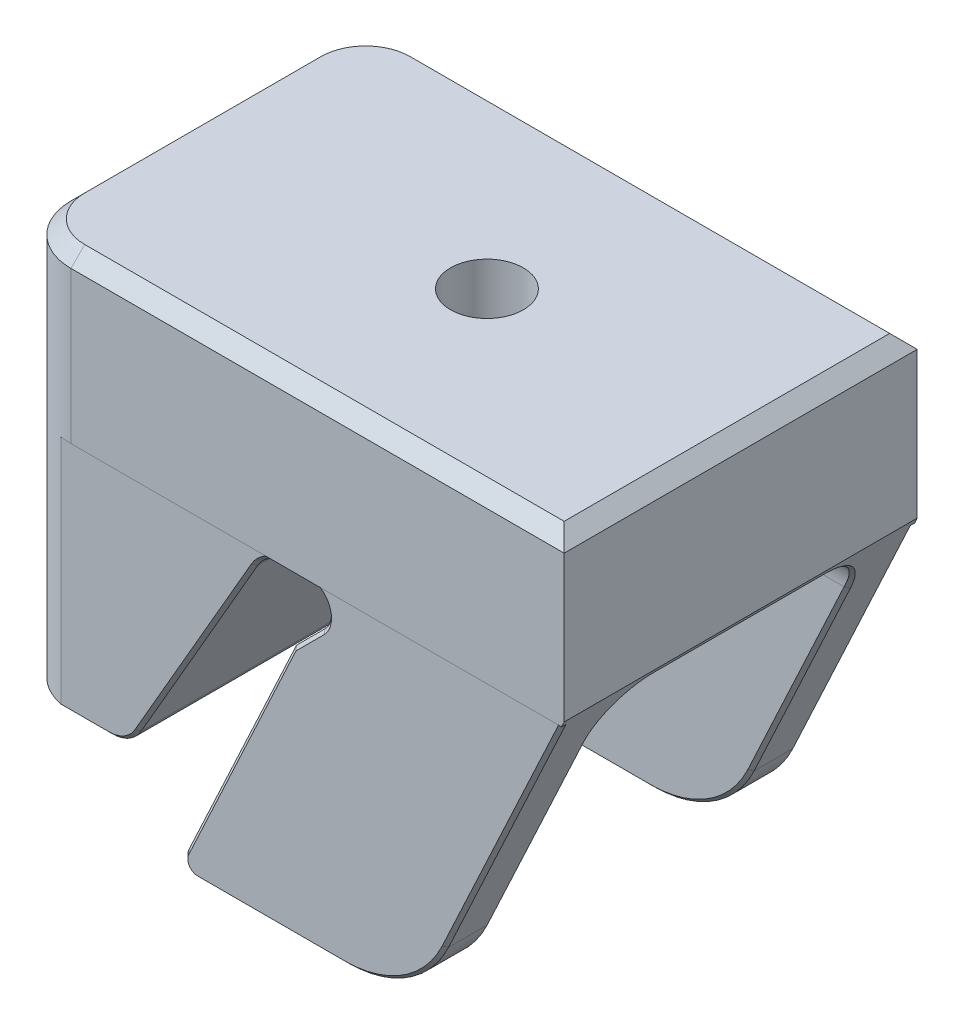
ISO-10303-21;
HEADER;
FILE_DESCRIPTION(('STEP AP214'),'2;1');
FILE_NAME('part.step','',(''),(''),'','','');
FILE_SCHEMA(('AUTOMOTIVE_DESIGN { 1 0 10303 214 1 1 1 1 }'));
ENDSEC;
DATA;
#1=APPLICATION_CONTEXT('core data for automotive mechanical design processes');
#2=APPLICATION_PROTOCOL_DEFINITION('international standard','automotive_design',2000,#1);
#3=PRODUCT_CONTEXT('',#1,'mechanical');
#4=PRODUCT('Part','Part','',(#3));
#5=PRODUCT_RELATED_PRODUCT_CATEGORY('part','',(#4));
#6=PRODUCT_DEFINITION_FORMATION('','',#4);
#7=PRODUCT_DEFINITION_CONTEXT('part definition',#1,'design');
#8=PRODUCT_DEFINITION('design','',#6,#7);
#9=PRODUCT_DEFINITION_SHAPE('','',#8);
#10=(LENGTH_UNIT() NAMED_UNIT(*) SI_UNIT(.MILLI.,.METRE.));
#11=(NAMED_UNIT(*) PLANE_ANGLE_UNIT() SI_UNIT($,.RADIAN.));
#12=(NAMED_UNIT(*) SI_UNIT($,.STERADIAN.) SOLID_ANGLE_UNIT());
#13=UNCERTAINTY_MEASURE_WITH_UNIT(LENGTH_MEASURE(1.E-05),#10,'distance_accuracy_value','');
#14=(GEOMETRIC_REPRESENTATION_CONTEXT(3) GLOBAL_UNCERTAINTY_ASSIGNED_CONTEXT((#13)) GLOBAL_UNIT_ASSIGNED_CONTEXT((#10,
#11,#12)) REPRESENTATION_CONTEXT('',''));
#15=CARTESIAN_POINT('',(0.,0.,0.));
#16=DIRECTION('',(0.,0.,1.));
#17=DIRECTION('',(1.,0.,0.));
#18=AXIS2_PLACEMENT_3D('',#15,#16,#17);
#19=CARTESIAN_POINT('',(16.6872236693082,-42.4,-16.));
#20=DIRECTION('',(0.,0.,1.));
#21=DIRECTION('',(1.,0.,0.));
#22=AXIS2_PLACEMENT_3D('',#19,#20,#21);
#23=PLANE('',#22);
#24=DIRECTION('',(1.,0.,0.));
#25=VECTOR('',#24,1.);
#26=CARTESIAN_POINT('',(22.69,-15.,-16.));
#27=LINE('',#26,#25);
#28=CARTESIAN_POINT('',(5.3,-15.,-16.));
#29=VERTEX_POINT('',#28);
#30=CARTESIAN_POINT('',(49.7668461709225,-15.,-16.));
#31=VERTEX_POINT('',#30);
#32=EDGE_CURVE('E1148',#29,#31,#27,.T.);
#33=ORIENTED_EDGE('',*,*,#32,.F.);
#34=DIRECTION('',(0.,-1.,0.));
#35=VECTOR('',#34,1.);
#36=CARTESIAN_POINT('',(5.3,-42.4,-16.));
#37=LINE('',#36,#35);
#38=CARTESIAN_POINT('',(5.3,-1.25000000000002,-16.));
#39=VERTEX_POINT('',#38);
#40=EDGE_CURVE('E1226',#29,#39,#37,.F.);
#41=ORIENTED_EDGE('',*,*,#40,.T.);
#42=DIRECTION('',(1.,0.,0.));
#43=VECTOR('',#42,1.);
#44=CARTESIAN_POINT('',(16.6872236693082,-1.25000000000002,-16.));
#45=LINE('',#44,#43);
#46=CARTESIAN_POINT('',(50.,-1.25000000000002,-16.));
#47=VERTEX_POINT('',#46);
#48=EDGE_CURVE('E1273',#39,#47,#45,.T.);
#49=ORIENTED_EDGE('',*,*,#48,.T.);
#50=DIRECTION('',(0.,1.,0.));
#51=VECTOR('',#50,1.);
#52=CARTESIAN_POINT('',(50.,0.,-16.));
#53=LINE('',#52,#51);
#54=CARTESIAN_POINT('',(50.,-14.5,-16.));
#55=VERTEX_POINT('',#54);
#56=EDGE_CURVE('E2113',#55,#47,#53,.T.);
#57=ORIENTED_EDGE('',*,*,#56,.F.);
#58=DIRECTION('',(-0.422618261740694,-0.906307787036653,0.));
#59=VECTOR('',#58,1.);
#60=CARTESIAN_POINT('',(50.,-14.5,-16.));
#61=LINE('',#60,#59);
#62=EDGE_CURVE('E476',#55,#31,#61,.T.);
#63=ORIENTED_EDGE('',*,*,#62,.T.);
#64=EDGE_LOOP('',(#33,#41,#49,#57,#63));
#65=FACE_BOUND('',#64,.T.);
#66=ADVANCED_FACE('F37',(#65),#23,.F.);
#67=CARTESIAN_POINT('',(5.3,-36.3,-10.7));
#68=DIRECTION('',(0.,-1.,0.));
#69=DIRECTION('',(0.,0.,-1.));
#70=AXIS2_PLACEMENT_3D('',#67,#68,#69);
#71=CYLINDRICAL_SURFACE('',#70,5.3);
#72=DIRECTION('',(0.,-1.,0.));
#73=VECTOR('',#72,1.);
#74=CARTESIAN_POINT('',(4.27530492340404,-36.3,-15.9));
#75=LINE('',#74,#73);
#76=CARTESIAN_POINT('',(4.27530492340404,-36.,-15.9));
#77=VERTEX_POINT('',#76);
#78=CARTESIAN_POINT('',(4.27530492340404,-15.,-15.9));
#79=VERTEX_POINT('',#78);
#80=EDGE_CURVE('E443',#77,#79,#75,.F.);
#81=ORIENTED_EDGE('',*,*,#80,.F.);
#82=CARTESIAN_POINT('',(5.3,-36.,-10.7));
#83=DIRECTION('',(0.,1.,0.));
#84=DIRECTION('',(0.,0.,1.));
#85=AXIS2_PLACEMENT_3D('',#82,#83,#84);
#86=CIRCLE('',#85,5.3);
#87=CARTESIAN_POINT('',(0.1,-36.,-11.724695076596));
#88=VERTEX_POINT('',#87);
#89=EDGE_CURVE('E437',#77,#88,#86,.T.);
#90=ORIENTED_EDGE('',*,*,#89,.T.);
#91=DIRECTION('',(0.,-1.,0.));
#92=VECTOR('',#91,1.);
#93=CARTESIAN_POINT('',(0.1,-36.3,-11.724695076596));
#94=LINE('',#93,#92);
#95=CARTESIAN_POINT('',(0.1,-15.,-11.724695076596));
#96=VERTEX_POINT('',#95);
#97=EDGE_CURVE('E424',#96,#88,#94,.T.);
#98=ORIENTED_EDGE('',*,*,#97,.F.);
#99=CARTESIAN_POINT('',(5.3,-15.,-10.7));
#100=DIRECTION('',(0.,1.,0.));
#101=DIRECTION('',(0.,0.,1.));
#102=AXIS2_PLACEMENT_3D('',#99,#100,#101);
#103=CIRCLE('',#102,5.3);
#104=CARTESIAN_POINT('',(0.,-15.,-10.7));
#105=VERTEX_POINT('',#104);
#106=EDGE_CURVE('E412',#105,#96,#103,.F.);
#107=ORIENTED_EDGE('',*,*,#106,.F.);
#108=DIRECTION('',(0.,-1.,0.));
#109=VECTOR('',#108,1.);
#110=CARTESIAN_POINT('',(0.,-36.3,-10.7));
#111=LINE('',#110,#109);
#112=CARTESIAN_POINT('',(0.,-1.25000000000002,-10.7));
#113=VERTEX_POINT('',#112);
#114=EDGE_CURVE('E1224',#113,#105,#111,.T.);
#115=ORIENTED_EDGE('',*,*,#114,.F.);
#116=CARTESIAN_POINT('',(5.3,-1.25000000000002,-10.7));
#117=DIRECTION('',(0.,-1.,0.));
#118=DIRECTION('',(0.,0.,-1.));
#119=AXIS2_PLACEMENT_3D('',#116,#117,#118);
#120=CIRCLE('',#119,5.3);
#121=EDGE_CURVE('E1270',#113,#39,#120,.T.);
#122=ORIENTED_EDGE('',*,*,#121,.T.);
#123=ORIENTED_EDGE('',*,*,#40,.F.);
#124=CARTESIAN_POINT('',(5.3,-15.,-10.7));
#125=DIRECTION('',(0.,-1.,0.));
#126=DIRECTION('',(0.,0.,-1.));
#127=AXIS2_PLACEMENT_3D('',#124,#125,#126);
#128=CIRCLE('',#127,5.3);
#129=EDGE_CURVE('E446',#29,#79,#128,.F.);
#130=ORIENTED_EDGE('',*,*,#129,.T.);
#131=EDGE_LOOP('',(#81,#90,#98,#107,#115,#122,#123,#130));
#132=FACE_BOUND('',#131,.T.);
#133=ADVANCED_FACE('F435',(#132),#71,.T.);
#134=CARTESIAN_POINT('',(50.,-14.5,-16.));
#135=DIRECTION('',(-0.906307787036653,0.422618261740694,0.));
#136=DIRECTION('',(-0.422618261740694,-0.906307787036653,0.));
#137=AXIS2_PLACEMENT_3D('',#134,#135,#136);
#138=PLANE('',#137);
#139=DIRECTION('',(0.,0.,-1.));
#140=VECTOR('',#139,1.);
#141=CARTESIAN_POINT('',(49.7668461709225,-15.,-16.));
#142=LINE('',#141,#140);
#143=CARTESIAN_POINT('',(49.7668461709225,-15.,16.));
#144=VERTEX_POINT('',#143);
#145=CARTESIAN_POINT('',(49.7668461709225,-15.,15.6));
#146=VERTEX_POINT('',#145);
#147=EDGE_CURVE('E778',#144,#146,#142,.T.);
#148=ORIENTED_EDGE('',*,*,#147,.T.);
#149=DIRECTION('',(-0.422618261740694,-0.906307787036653,0.));
#150=VECTOR('',#149,1.);
#151=CARTESIAN_POINT('',(50.,-14.5,15.6));
#152=LINE('',#151,#150);
#153=CARTESIAN_POINT('',(39.1228224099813,-37.8261826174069,15.6));
#154=VERTEX_POINT('',#153);
#155=EDGE_CURVE('E881',#146,#154,#152,.T.);
#156=ORIENTED_EDGE('',*,*,#155,.T.);
#157=DIRECTION('',(0.,0.,1.));
#158=VECTOR('',#157,1.);
#159=CARTESIAN_POINT('',(39.1228224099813,-37.8261826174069,-16.));
#160=LINE('',#159,#158);
#161=CARTESIAN_POINT('',(39.1228224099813,-37.8261826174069,12.1));
#162=VERTEX_POINT('',#161);
#163=EDGE_CURVE('E1233',#154,#162,#160,.F.);
#164=ORIENTED_EDGE('',*,*,#163,.T.);
#165=DIRECTION('',(0.422618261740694,0.906307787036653,0.));
#166=VECTOR('',#165,1.);
#167=CARTESIAN_POINT('',(50.,-14.5,12.1));
#168=LINE('',#167,#166);
#169=CARTESIAN_POINT('',(47.8424944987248,-19.1267854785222,12.1));
#170=VERTEX_POINT('',#169);
#171=EDGE_CURVE('E560',#162,#170,#168,.T.);
#172=ORIENTED_EDGE('',*,*,#171,.T.);
#173=CARTESIAN_POINT('',(49.8476174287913,-14.8267854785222,7.80000000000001));
#174=CARTESIAN_POINT('',(49.8497474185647,-14.8222177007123,8.92730707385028));
#175=CARTESIAN_POINT('',(49.63203972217,-15.2890933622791,10.0434262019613));
#176=CARTESIAN_POINT('',(48.8886213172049,-16.883359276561,11.6376921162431));
#177=CARTESIAN_POINT('',(48.3681664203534,-17.999478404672,12.1045677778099));
#178=CARTESIAN_POINT('',(47.8424944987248,-19.1267854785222,12.1));
#179=B_SPLINE_CURVE_WITH_KNOTS('',3,(#173,#174,#175,#176,#177,#178),.UNSPECIFIED.,.F.,.F.,(4,2,
4),(4.71238898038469,5.49778714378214,6.28318530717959),.UNSPECIFIED.);
#180=CARTESIAN_POINT('',(49.8476174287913,-14.8267854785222,7.80000000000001));
#181=VERTEX_POINT('',#180);
#182=EDGE_CURVE('E568',#170,#181,#179,.F.);
#183=ORIENTED_EDGE('',*,*,#182,.T.);
#184=DIRECTION('',(0.,0.,-1.));
#185=VECTOR('',#184,1.);
#186=CARTESIAN_POINT('',(49.8476174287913,-14.8267854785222,-16.));
#187=LINE('',#186,#185);
#188=CARTESIAN_POINT('',(49.8476174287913,-14.8267854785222,-7.79999999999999));
#189=VERTEX_POINT('',#188);
#190=EDGE_CURVE('E2230',#181,#189,#187,.T.);
#191=ORIENTED_EDGE('',*,*,#190,.T.);
#192=CARTESIAN_POINT('',(47.8424944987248,-19.1267854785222,-12.1));
#193=CARTESIAN_POINT('',(48.3681664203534,-17.999478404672,-12.1045677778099));
#194=CARTESIAN_POINT('',(48.8886213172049,-16.883359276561,-11.6376921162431));
#195=CARTESIAN_POINT('',(49.63203972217,-15.2890933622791,-10.0434262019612));
#196=CARTESIAN_POINT('',(49.8497474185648,-14.8222177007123,-8.92730707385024));
#197=CARTESIAN_POINT('',(49.8476174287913,-14.8267854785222,-7.8));
#198=B_SPLINE_CURVE_WITH_KNOTS('',3,(#192,#193,#194,#195,#196,#197),.UNSPECIFIED.,.F.,.F.,(4,2,
4),(0.,0.785398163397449,1.5707963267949),.UNSPECIFIED.);
#199=CARTESIAN_POINT('',(47.8424944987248,-19.1267854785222,-12.1));
#200=VERTEX_POINT('',#199);
#201=EDGE_CURVE('E530',#189,#200,#198,.F.);
#202=ORIENTED_EDGE('',*,*,#201,.T.);
#203=DIRECTION('',(-0.422618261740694,-0.906307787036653,0.));
#204=VECTOR('',#203,1.);
#205=CARTESIAN_POINT('',(50.,-14.5,-12.1));
#206=LINE('',#205,#204);
#207=CARTESIAN_POINT('',(39.1228224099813,-37.8261826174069,-12.1));
#208=VERTEX_POINT('',#207);
#209=EDGE_CURVE('E526',#200,#208,#206,.T.);
#210=ORIENTED_EDGE('',*,*,#209,.T.);
#211=DIRECTION('',(0.,0.,1.));
#212=VECTOR('',#211,1.);
#213=CARTESIAN_POINT('',(39.1228224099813,-37.8261826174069,-16.));
#214=LINE('',#213,#212);
#215=CARTESIAN_POINT('',(39.1228224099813,-37.8261826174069,-15.6));
#216=VERTEX_POINT('',#215);
#217=EDGE_CURVE('E1235',#208,#216,#214,.F.);
#218=ORIENTED_EDGE('',*,*,#217,.T.);
#219=DIRECTION('',(0.422618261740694,0.906307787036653,0.));
#220=VECTOR('',#219,1.);
#221=CARTESIAN_POINT('',(50.,-14.5,-15.6));
#222=LINE('',#221,#220);
#223=CARTESIAN_POINT('',(49.7668461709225,-15.,-15.6));
#224=VERTEX_POINT('',#223);
#225=EDGE_CURVE('E878',#216,#224,#222,.T.);
#226=ORIENTED_EDGE('',*,*,#225,.T.);
#227=DIRECTION('',(0.,0.,1.));
#228=VECTOR('',#227,1.);
#229=CARTESIAN_POINT('',(49.7668461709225,-15.,-16.));
#230=LINE('',#229,#228);
#231=EDGE_CURVE('E785',#31,#224,#230,.T.);
#232=ORIENTED_EDGE('',*,*,#231,.F.);
#233=ORIENTED_EDGE('',*,*,#62,.F.);
#234=DIRECTION('',(0.,0.,1.));
#235=VECTOR('',#234,1.);
#236=CARTESIAN_POINT('',(50.,-14.5,-16.));
#237=LINE('',#236,#235);
#238=CARTESIAN_POINT('',(50.,-14.5,16.));
#239=VERTEX_POINT('',#238);
#240=EDGE_CURVE('E479',#55,#239,#237,.T.);
#241=ORIENTED_EDGE('',*,*,#240,.T.);
#242=DIRECTION('',(-0.422618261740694,-0.906307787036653,0.));
#243=VECTOR('',#242,1.);
#244=CARTESIAN_POINT('',(50.,-14.5,16.));
#245=LINE('',#244,#243);
#246=EDGE_CURVE('E480',#239,#144,#245,.T.);
#247=ORIENTED_EDGE('',*,*,#246,.T.);
#248=EDGE_LOOP('',(#148,#156,#164,#172,#183,#191,#202,#210,#218,#226,#232,#233,#241,#247));
#249=FACE_BOUND('',#248,.T.);
#250=ADVANCED_FACE('F537',(#249),#138,.F.);
#251=CARTESIAN_POINT('',(22.69,-15.,16.));
#252=DIRECTION('',(-0.866025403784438,0.500000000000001,0.));
#253=DIRECTION('',(-0.500000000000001,-0.866025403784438,0.));
#254=AXIS2_PLACEMENT_3D('',#251,#252,#253);
#255=PLANE('',#254);
#256=DIRECTION('',(0.,0.,-1.));
#257=VECTOR('',#256,1.);
#258=CARTESIAN_POINT('',(11.2584646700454,-34.8,16.));
#259=LINE('',#258,#257);
#260=CARTESIAN_POINT('',(11.2584646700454,-34.8,15.6));
#261=VERTEX_POINT('',#260);
#262=CARTESIAN_POINT('',(11.2584646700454,-34.8,-15.6));
#263=VERTEX_POINT('',#262);
#264=EDGE_CURVE('E1213',#261,#263,#259,.T.);
#265=ORIENTED_EDGE('',*,*,#264,.T.);
#266=DIRECTION('',(0.500000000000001,0.866025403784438,0.));
#267=VECTOR('',#266,1.);
#268=CARTESIAN_POINT('',(22.69,-15.,-15.6));
#269=LINE('',#268,#267);
#270=CARTESIAN_POINT('',(21.8239745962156,-16.5,-15.6));
#271=VERTEX_POINT('',#270);
#272=EDGE_CURVE('E851',#263,#271,#269,.T.);
#273=ORIENTED_EDGE('',*,*,#272,.T.);
#274=DIRECTION('',(0.,0.,-1.));
#275=VECTOR('',#274,1.);
#276=CARTESIAN_POINT('',(21.8239745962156,-16.5,16.));
#277=LINE('',#276,#275);
#278=CARTESIAN_POINT('',(21.8239745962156,-16.5,-1.85977445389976));
#279=VERTEX_POINT('',#278);
#280=EDGE_CURVE('E1245',#271,#279,#277,.F.);
#281=ORIENTED_EDGE('',*,*,#280,.T.);
#282=CARTESIAN_POINT('',(27.,-7.53486101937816,0.));
#283=DIRECTION('',(-0.866025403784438,0.500000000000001,0.));
#284=DIRECTION('',(0.500000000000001,0.866025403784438,0.));
#285=AXIS2_PLACEMENT_3D('',#282,#283,#284);
#286=ELLIPSE('',#285,11.,5.5);
#287=CARTESIAN_POINT('',(21.8239745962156,-16.5,1.85977445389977));
#288=VERTEX_POINT('',#287);
#289=EDGE_CURVE('E472',#288,#279,#286,.F.);
#290=ORIENTED_EDGE('',*,*,#289,.F.);
#291=CARTESIAN_POINT('',(21.8239745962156,-16.5,15.6));
#292=VERTEX_POINT('',#291);
#293=EDGE_CURVE('E1244',#288,#292,#277,.F.);
#294=ORIENTED_EDGE('',*,*,#293,.T.);
#295=DIRECTION('',(-0.500000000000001,-0.866025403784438,0.));
#296=VECTOR('',#295,1.);
#297=CARTESIAN_POINT('',(22.69,-15.,15.6));
#298=LINE('',#297,#296);
#299=EDGE_CURVE('E849',#292,#261,#298,.T.);
#300=ORIENTED_EDGE('',*,*,#299,.T.);
#301=EDGE_LOOP('',(#265,#273,#281,#290,#294,#300));
#302=FACE_BOUND('',#301,.T.);
#303=ADVANCED_FACE('F547',(#302),#255,.F.);
#304=CARTESIAN_POINT('',(22.69,-15.,16.));
#305=DIRECTION('',(0.,1.,0.));
#306=DIRECTION('',(-1.,0.,0.));
#307=AXIS2_PLACEMENT_3D('',#304,#305,#306);
#308=PLANE('',#307);
#309=DIRECTION('',(0.,0.,-1.));
#310=VECTOR('',#309,1.);
#311=CARTESIAN_POINT('',(24.4220508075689,-15.,-16.));
#312=LINE('',#311,#310);
#313=CARTESIAN_POINT('',(24.4220508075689,-15.,-4.85841311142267));
#314=VERTEX_POINT('',#313);
#315=CARTESIAN_POINT('',(24.4220508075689,-15.,-15.6));
#316=VERTEX_POINT('',#315);
#317=EDGE_CURVE('E1241',#314,#316,#312,.T.);
#318=ORIENTED_EDGE('',*,*,#317,.T.);
#319=CARTESIAN_POINT('',(24.4220508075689,-15.,-15.6));
#320=CARTESIAN_POINT('',(24.3760215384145,-15.,-15.5999963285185));
#321=CARTESIAN_POINT('',(24.3299991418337,-15.,-15.6010598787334));
#322=CARTESIAN_POINT('',(24.2380578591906,-15.,-15.6052868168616));
#323=CARTESIAN_POINT('',(24.1921389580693,-15.,-15.6084498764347));
#324=CARTESIAN_POINT('',(24.0548091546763,-15.,-15.6210224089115));
#325=CARTESIAN_POINT('',(23.96366526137,-15.,-15.6335154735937));
#326=CARTESIAN_POINT('',(23.7839772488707,-15.,-15.6658469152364));
#327=CARTESIAN_POINT('',(23.6954146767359,-15.,-15.6855854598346));
#328=CARTESIAN_POINT('',(23.5199901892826,-15.,-15.7315403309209));
#329=CARTESIAN_POINT('',(23.4331284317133,-15.,-15.7577572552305));
#330=CARTESIAN_POINT('',(23.2966729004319,-15.,-15.8037803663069));
#331=CARTESIAN_POINT('',(23.2464576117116,-15.,-15.8217826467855));
#332=CARTESIAN_POINT('',(23.1464770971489,-15.,-15.8595921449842));
#333=CARTESIAN_POINT('',(23.096714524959,-15.,-15.879406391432));
#334=CARTESIAN_POINT('',(23.0472780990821,-15.,-15.9));
#335=B_SPLINE_CURVE_WITH_KNOTS('',3,(#319,#320,#321,#322,#323,#324,#325,#326,#327,#328,#329,
#330,#331,#332,#333,#334),.UNSPECIFIED.,.F.,.F.,(4,2,2,2,2,2,2,4),(0.,0.138062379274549,
0.276103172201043,0.551706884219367,0.823647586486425,1.0956133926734,1.25561948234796,
1.41627494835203),.UNSPECIFIED.);
#336=CARTESIAN_POINT('',(23.0472780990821,-15.,-15.9));
#337=VERTEX_POINT('',#336);
#338=EDGE_CURVE('E970',#316,#337,#335,.T.);
#339=ORIENTED_EDGE('',*,*,#338,.T.);
#340=DIRECTION('',(-1.,0.,0.));
#341=VECTOR('',#340,1.);
#342=CARTESIAN_POINT('',(3.,-15.,-15.9));
#343=LINE('',#342,#341);
#344=EDGE_CURVE('E423',#337,#79,#343,.T.);
#345=ORIENTED_EDGE('',*,*,#344,.T.);
#346=ORIENTED_EDGE('',*,*,#129,.F.);
#347=ORIENTED_EDGE('',*,*,#32,.T.);
#348=ORIENTED_EDGE('',*,*,#231,.T.);
#349=DIRECTION('',(0.740965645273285,0.,0.671542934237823));
#350=VECTOR('',#349,1.);
#351=CARTESIAN_POINT('',(50.6246946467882,-15.,-14.8225252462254));
#352=LINE('',#351,#350);
#353=CARTESIAN_POINT('',(49.4358327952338,-15.,-15.9));
#354=VERTEX_POINT('',#353);
#355=EDGE_CURVE('E11',#224,#354,#352,.F.);
#356=ORIENTED_EDGE('',*,*,#355,.T.);
#357=CARTESIAN_POINT('',(27.6495085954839,-15.,-15.9));
#358=VERTEX_POINT('',#357);
#359=EDGE_CURVE('E442',#354,#358,#343,.T.);
#360=ORIENTED_EDGE('',*,*,#359,.T.);
#361=CARTESIAN_POINT('',(27.6495085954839,-15.,-15.9));
#362=CARTESIAN_POINT('',(27.5707629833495,-15.,-15.8611467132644));
#363=CARTESIAN_POINT('',(27.4906982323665,-15.,-15.824633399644));
#364=CARTESIAN_POINT('',(27.3274423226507,-15.,-15.7578953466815));
#365=CARTESIAN_POINT('',(27.244235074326,-15.,-15.727710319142));
#366=CARTESIAN_POINT('',(27.0775621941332,-15.,-15.6764921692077));
#367=CARTESIAN_POINT('',(26.9941707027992,-15.,-15.6552239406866));
#368=CARTESIAN_POINT('',(26.8256531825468,-15.,-15.6225021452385));
#369=CARTESIAN_POINT('',(26.7405330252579,-15.,-15.6110196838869));
#370=CARTESIAN_POINT('',(26.6316050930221,-15.,-15.6033322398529));
#371=CARTESIAN_POINT('',(26.6081019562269,-15.,-15.6020868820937));
#372=CARTESIAN_POINT('',(26.5609763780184,-15.,-15.600419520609));
#373=CARTESIAN_POINT('',(26.5373538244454,-15.,-15.6000006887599));
#374=CARTESIAN_POINT('',(26.5137269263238,-15.,-15.6));
#375=B_SPLINE_CURVE_WITH_KNOTS('',3,(#361,#362,#363,#364,#365,#366,#367,#368,#369,#370,#371,
#372,#373,#374),.UNSPECIFIED.,.F.,.F.,(4,2,2,2,2,2,4),(0.,0.263614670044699,0.528837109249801,
0.786543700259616,1.04348669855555,1.11408468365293,1.18495307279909),.UNSPECIFIED.);
#376=CARTESIAN_POINT('',(26.5137269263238,-15.,-15.6));
#377=VERTEX_POINT('',#376);
#378=EDGE_CURVE('E891',#358,#377,#375,.T.);
#379=ORIENTED_EDGE('',*,*,#378,.T.);
#380=DIRECTION('',(0.,0.,-1.));
#381=VECTOR('',#380,1.);
#382=CARTESIAN_POINT('',(26.5137269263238,-15.,16.));
#383=LINE('',#382,#381);
#384=CARTESIAN_POINT('',(26.5137269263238,-15.,-7.8));
#385=VERTEX_POINT('',#384);
#386=EDGE_CURVE('E1203',#385,#377,#383,.T.);
#387=ORIENTED_EDGE('',*,*,#386,.F.);
#388=DIRECTION('',(1.,0.,0.));
#389=VECTOR('',#388,1.);
#390=CARTESIAN_POINT('',(-25.5141638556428,-15.,-7.8));
#391=LINE('',#390,#389);
#392=CARTESIAN_POINT('',(49.5757250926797,-15.,-7.8));
#393=VERTEX_POINT('',#392);
#394=EDGE_CURVE('E495',#385,#393,#391,.T.);
#395=ORIENTED_EDGE('',*,*,#394,.T.);
#396=DIRECTION('',(0.,0.,1.));
#397=VECTOR('',#396,1.);
#398=CARTESIAN_POINT('',(49.5757250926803,-15.,16.));
#399=LINE('',#398,#397);
#400=CARTESIAN_POINT('',(49.5757250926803,-15.,7.8));
#401=VERTEX_POINT('',#400);
#402=EDGE_CURVE('E586',#393,#401,#399,.T.);
#403=ORIENTED_EDGE('',*,*,#402,.T.);
#404=DIRECTION('',(1.,0.,0.));
#405=VECTOR('',#404,1.);
#406=CARTESIAN_POINT('',(-25.5141638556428,-15.,7.8));
#407=LINE('',#406,#405);
#408=CARTESIAN_POINT('',(26.5137269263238,-15.,7.8));
#409=VERTEX_POINT('',#408);
#410=EDGE_CURVE('E485',#409,#401,#407,.T.);
#411=ORIENTED_EDGE('',*,*,#410,.F.);
#412=CARTESIAN_POINT('',(26.5137269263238,-15.,15.6));
#413=VERTEX_POINT('',#412);
#414=EDGE_CURVE('E1210',#413,#409,#383,.T.);
#415=ORIENTED_EDGE('',*,*,#414,.F.);
#416=CARTESIAN_POINT('',(26.5137269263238,-15.,15.6));
#417=CARTESIAN_POINT('',(26.5751653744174,-15.,15.5999485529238));
#418=CARTESIAN_POINT('',(26.6365725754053,-15.,15.6028297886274));
#419=CARTESIAN_POINT('',(26.7587809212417,-15.,15.6140533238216));
#420=CARTESIAN_POINT('',(26.8195829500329,-15.,15.622385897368));
#421=CARTESIAN_POINT('',(26.9393562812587,-15.,15.6439479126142));
#422=CARTESIAN_POINT('',(26.9983413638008,-15.,15.6571022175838));
#423=CARTESIAN_POINT('',(27.1151876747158,-15.,15.6877209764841));
#424=CARTESIAN_POINT('',(27.1730485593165,-15.,15.7051867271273));
#425=CARTESIAN_POINT('',(27.3017621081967,-15.,15.7485947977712));
#426=CARTESIAN_POINT('',(27.3722639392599,-15.,15.7755649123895));
#427=CARTESIAN_POINT('',(27.5120156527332,-15.,15.8344012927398));
#428=CARTESIAN_POINT('',(27.5812466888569,-15.,15.8663126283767));
#429=CARTESIAN_POINT('',(27.6495085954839,-15.,15.9));
#430=B_SPLINE_CURVE_WITH_KNOTS('',3,(#416,#417,#418,#419,#420,#421,#422,#423,#424,#425,#426,
#427,#428,#429),.UNSPECIFIED.,.F.,.F.,(4,2,2,2,2,2,4),(0.,0.184197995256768,0.368068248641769,
0.549187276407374,0.730360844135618,0.956627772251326,1.18509543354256),.UNSPECIFIED.);
#431=CARTESIAN_POINT('',(27.6495085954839,-15.,15.9));
#432=VERTEX_POINT('',#431);
#433=EDGE_CURVE('E899',#413,#432,#430,.T.);
#434=ORIENTED_EDGE('',*,*,#433,.T.);
#435=DIRECTION('',(-1.,0.,0.));
#436=VECTOR('',#435,1.);
#437=CARTESIAN_POINT('',(3.,-15.,15.9));
#438=LINE('',#437,#436);
#439=CARTESIAN_POINT('',(49.4358327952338,-15.,15.9));
#440=VERTEX_POINT('',#439);
#441=EDGE_CURVE('E451',#440,#432,#438,.T.);
#442=ORIENTED_EDGE('',*,*,#441,.F.);
#443=DIRECTION('',(-0.740965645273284,0.,0.671542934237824));
#444=VECTOR('',#443,1.);
#445=CARTESIAN_POINT('',(34.7018068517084,-15.,29.2535624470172));
#446=LINE('',#445,#444);
#447=EDGE_CURVE('E47',#440,#146,#446,.F.);
#448=ORIENTED_EDGE('',*,*,#447,.T.);
#449=ORIENTED_EDGE('',*,*,#147,.F.);
#450=DIRECTION('',(1.,0.,0.));
#451=VECTOR('',#450,1.);
#452=CARTESIAN_POINT('',(22.69,-15.,16.));
#453=LINE('',#452,#451);
#454=CARTESIAN_POINT('',(5.3,-15.,16.));
#455=VERTEX_POINT('',#454);
#456=EDGE_CURVE('E1151',#455,#144,#453,.T.);
#457=ORIENTED_EDGE('',*,*,#456,.F.);
#458=CARTESIAN_POINT('',(5.3,-15.,10.7));
#459=DIRECTION('',(0.,1.,0.));
#460=DIRECTION('',(0.,0.,1.));
#461=AXIS2_PLACEMENT_3D('',#458,#459,#460);
#462=CIRCLE('',#461,5.3);
#463=CARTESIAN_POINT('',(4.27530492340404,-15.,15.9));
#464=VERTEX_POINT('',#463);
#465=EDGE_CURVE('E455',#455,#464,#462,.F.);
#466=ORIENTED_EDGE('',*,*,#465,.T.);
#467=CARTESIAN_POINT('',(23.0472780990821,-15.,15.9));
#468=VERTEX_POINT('',#467);
#469=EDGE_CURVE('E449',#468,#464,#438,.T.);
#470=ORIENTED_EDGE('',*,*,#469,.F.);
#471=CARTESIAN_POINT('',(23.0472780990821,-15.,15.9));
#472=CARTESIAN_POINT('',(23.1565595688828,-15.,15.8544484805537));
#473=CARTESIAN_POINT('',(23.2676441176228,-15.,15.8126738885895));
#474=CARTESIAN_POINT('',(23.4918363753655,-15.,15.7391481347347));
#475=CARTESIAN_POINT('',(23.6049131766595,-15.,15.7073018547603));
#476=CARTESIAN_POINT('',(23.776611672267,-15.,15.6681379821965));
#477=CARTESIAN_POINT('',(23.8342513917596,-15.,15.656510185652));
#478=CARTESIAN_POINT('',(23.9500733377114,-15.,15.6363649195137));
#479=CARTESIAN_POINT('',(24.0082555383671,-15.,15.6278473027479));
#480=CARTESIAN_POINT('',(24.125588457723,-15.,15.6140452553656));
#481=CARTESIAN_POINT('',(24.184743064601,-15.,15.608793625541));
#482=CARTESIAN_POINT('',(24.3032801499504,-15.,15.601763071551));
#483=CARTESIAN_POINT('',(24.3626627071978,-15.,15.5999854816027));
#484=CARTESIAN_POINT('',(24.4220508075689,-15.,15.6));
#485=B_SPLINE_CURVE_WITH_KNOTS('',3,(#471,#472,#473,#474,#475,#476,#477,#478,#479,#480,#481,
#482,#483,#484),.UNSPECIFIED.,.F.,.F.,(4,2,2,2,2,2,4),(0.,0.355451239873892,0.707384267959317,
0.883709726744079,1.06002684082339,1.23808728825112,1.41621610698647),.UNSPECIFIED.);
#486=CARTESIAN_POINT('',(24.4220508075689,-15.,15.6));
#487=VERTEX_POINT('',#486);
#488=EDGE_CURVE('E976',#468,#487,#485,.T.);
#489=ORIENTED_EDGE('',*,*,#488,.T.);
#490=CARTESIAN_POINT('',(24.4220508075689,-15.,4.85841311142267));
#491=VERTEX_POINT('',#490);
#492=EDGE_CURVE('E1242',#487,#491,#312,.T.);
#493=ORIENTED_EDGE('',*,*,#492,.T.);
#494=CARTESIAN_POINT('',(27.,-15.,0.));
#495=DIRECTION('',(0.,1.,0.));
#496=DIRECTION('',(-1.,0.,0.));
#497=AXIS2_PLACEMENT_3D('',#494,#495,#496);
#498=CIRCLE('',#497,5.5);
#499=EDGE_CURVE('E469',#314,#491,#498,.F.);
#500=ORIENTED_EDGE('',*,*,#499,.F.);
#501=EDGE_LOOP('',(#318,#339,#345,#346,#347,#348,#356,#360,#379,#387,#395,#403,#411,#415,#434,
#442,#448,#449,#457,#466,#470,#489,#493,#500));
#502=FACE_BOUND('',#501,.T.);
#503=ADVANCED_FACE('F906',(#502),#308,.F.);
#504=CARTESIAN_POINT('',(0.,0.,16.));
#505=DIRECTION('',(0.,-1.,0.));
#506=DIRECTION('',(0.,0.,-1.));
#507=AXIS2_PLACEMENT_3D('',#504,#505,#506);
#508=PLANE('',#507);
#509=DIRECTION('',(1.,0.,0.));
#510=VECTOR('',#509,1.);
#511=CARTESIAN_POINT('',(50.,0.,14.75));
#512=LINE('',#511,#510);
#513=CARTESIAN_POINT('',(5.3,0.,14.75));
#514=VERTEX_POINT('',#513);
#515=CARTESIAN_POINT('',(48.75,0.,14.75));
#516=VERTEX_POINT('',#515);
#517=EDGE_CURVE('E1255',#514,#516,#512,.T.);
#518=ORIENTED_EDGE('',*,*,#517,.T.);
#519=DIRECTION('',(0.,0.,-1.));
#520=VECTOR('',#519,1.);
#521=CARTESIAN_POINT('',(48.75,0.,16.));
#522=LINE('',#521,#520);
#523=CARTESIAN_POINT('',(48.75,0.,-14.75));
#524=VERTEX_POINT('',#523);
#525=EDGE_CURVE('E1257',#516,#524,#522,.T.);
#526=ORIENTED_EDGE('',*,*,#525,.T.);
#527=DIRECTION('',(-1.,0.,0.));
#528=VECTOR('',#527,1.);
#529=CARTESIAN_POINT('',(0.,0.,-14.75));
#530=LINE('',#529,#528);
#531=CARTESIAN_POINT('',(5.3,0.,-14.75));
#532=VERTEX_POINT('',#531);
#533=EDGE_CURVE('E1247',#524,#532,#530,.T.);
#534=ORIENTED_EDGE('',*,*,#533,.T.);
#535=CARTESIAN_POINT('',(5.3,0.,-10.7));
#536=DIRECTION('',(0.,-1.,0.));
#537=DIRECTION('',(0.,0.,-1.));
#538=AXIS2_PLACEMENT_3D('',#535,#536,#537);
#539=CIRCLE('',#538,4.04999999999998);
#540=CARTESIAN_POINT('',(1.25000000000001,0.,-10.7));
#541=VERTEX_POINT('',#540);
#542=EDGE_CURVE('E1249',#532,#541,#539,.F.);
#543=ORIENTED_EDGE('',*,*,#542,.T.);
#544=DIRECTION('',(0.,0.,1.));
#545=VECTOR('',#544,1.);
#546=CARTESIAN_POINT('',(1.25000000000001,0.,16.));
#547=LINE('',#546,#545);
#548=CARTESIAN_POINT('',(1.25000000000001,0.,10.7));
#549=VERTEX_POINT('',#548);
#550=EDGE_CURVE('E1251',#541,#549,#547,.T.);
#551=ORIENTED_EDGE('',*,*,#550,.T.);
#552=CARTESIAN_POINT('',(5.3,0.,10.7));
#553=DIRECTION('',(0.,-1.,0.));
#554=DIRECTION('',(0.,0.,-1.));
#555=AXIS2_PLACEMENT_3D('',#552,#553,#554);
#556=CIRCLE('',#555,4.04999999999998);
#557=EDGE_CURVE('E1253',#549,#514,#556,.F.);
#558=ORIENTED_EDGE('',*,*,#557,.T.);
#559=EDGE_LOOP('',(#518,#526,#534,#543,#551,#558));
#560=FACE_BOUND('',#559,.T.);
#561=CARTESIAN_POINT('',(27.,0.,0.));
#562=DIRECTION('',(0.,1.,0.));
#563=DIRECTION('',(0.,0.,1.));
#564=AXIS2_PLACEMENT_3D('',#561,#562,#563);
#565=CIRCLE('',#564,3.3);
#566=CARTESIAN_POINT('',(27.,0.,3.3));
#567=VERTEX_POINT('',#566);
#568=EDGE_CURVE('E462',#567,#567,#565,.T.);
#569=ORIENTED_EDGE('',*,*,#568,.F.);
#570=EDGE_LOOP('',(#569));
#571=FACE_BOUND('',#570,.T.);
#572=ADVANCED_FACE('F1100',(#560,#571),#508,.F.);
#573=CARTESIAN_POINT('',(24.4220508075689,-18.,16.));
#574=DIRECTION('',(0.,0.,1.));
#575=DIRECTION('',(1.,0.,0.));
#576=AXIS2_PLACEMENT_3D('',#573,#574,#575);
#577=CYLINDRICAL_SURFACE('',#576,3.);
#578=ORIENTED_EDGE('',*,*,#280,.F.);
#579=CARTESIAN_POINT('',(24.4220508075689,-18.,-15.6));
#580=DIRECTION('',(0.,0.,1.));
#581=DIRECTION('',(1.,0.,0.));
#582=AXIS2_PLACEMENT_3D('',#579,#580,#581);
#583=CIRCLE('',#582,3.);
#584=EDGE_CURVE('E828',#271,#316,#583,.F.);
#585=ORIENTED_EDGE('',*,*,#584,.T.);
#586=ORIENTED_EDGE('',*,*,#317,.F.);
#587=CARTESIAN_POINT('',(21.8239745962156,-16.5,-1.85977445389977));
#588=CARTESIAN_POINT('',(21.8515463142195,-16.4522376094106,-1.93649528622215));
#589=CARTESIAN_POINT('',(21.8808290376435,-16.4045668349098,-2.012648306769));
#590=CARTESIAN_POINT('',(21.9428880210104,-16.3097461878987,-2.16386525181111));
#591=CARTESIAN_POINT('',(21.9756648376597,-16.2625963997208,-2.23892900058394));
#592=CARTESIAN_POINT('',(22.0795310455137,-16.1221859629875,-2.46295387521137));
#593=CARTESIAN_POINT('',(22.1559963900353,-16.0302465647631,-2.61030200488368));
#594=CARTESIAN_POINT('',(22.3253423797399,-15.8507358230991,-2.90287294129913));
#595=CARTESIAN_POINT('',(22.4185038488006,-15.7632786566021,-3.04800414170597));
#596=CARTESIAN_POINT('',(22.6206985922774,-15.5974603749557,-3.33197291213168));
#597=CARTESIAN_POINT('',(22.7297080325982,-15.5190859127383,-3.47081952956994));
#598=CARTESIAN_POINT('',(22.9831162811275,-15.362750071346,-3.76268250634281));
#599=CARTESIAN_POINT('',(23.1303872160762,-15.2868939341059,-3.91437258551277));
#600=CARTESIAN_POINT('',(23.4458491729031,-15.1582171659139,-4.20275374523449));
#601=CARTESIAN_POINT('',(23.6138473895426,-15.1052021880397,-4.33956365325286));
#602=CARTESIAN_POINT('',(23.8907975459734,-15.0456693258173,-4.53848060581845));
#603=CARTESIAN_POINT('',(23.9930731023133,-15.028956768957,-4.60690232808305));
#604=CARTESIAN_POINT('',(24.2034959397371,-15.006087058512,-4.73762499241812));
#605=CARTESIAN_POINT('',(24.3116768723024,-14.9999987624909,-4.79988355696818));
#606=CARTESIAN_POINT('',(24.4220508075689,-15.,-4.85841311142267));
#607=B_SPLINE_CURVE_WITH_KNOTS('',3,(#587,#588,#589,#590,#591,#592,#593,#594,#595,#596,#597,
#598,#599,#600,#601,#602,#603,#604,#605,#606),.UNSPECIFIED.,.F.,.F.,(4,2,2,2,2,2,2,2,2,4),(0.,
0.283421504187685,0.566888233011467,1.1354730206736,1.71471538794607,2.29309546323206,
2.96475674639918,3.63058448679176,4.00245879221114,4.37673444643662),.UNSPECIFIED.);
#608=EDGE_CURVE('E1296',#279,#314,#607,.T.);
#609=ORIENTED_EDGE('',*,*,#608,.F.);
#610=EDGE_LOOP('',(#578,#585,#586,#609));
#611=FACE_BOUND('',#610,.T.);
#612=ADVANCED_FACE('F1103',(#611),#577,.F.);
#613=ORIENTED_EDGE('',*,*,#492,.F.);
#614=CARTESIAN_POINT('',(24.4220508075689,-18.,15.6));
#615=DIRECTION('',(0.,0.,-1.));
#616=DIRECTION('',(-1.,0.,0.));
#617=AXIS2_PLACEMENT_3D('',#614,#615,#616);
#618=CIRCLE('',#617,3.);
#619=EDGE_CURVE('E857',#487,#292,#618,.F.);
#620=ORIENTED_EDGE('',*,*,#619,.T.);
#621=ORIENTED_EDGE('',*,*,#293,.F.);
#622=CARTESIAN_POINT('',(24.4220508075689,-15.,4.85841311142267));
#623=CARTESIAN_POINT('',(24.3285965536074,-14.9999945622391,4.80885114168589));
#624=CARTESIAN_POINT('',(24.2366611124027,-15.0043647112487,4.75658889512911));
#625=CARTESIAN_POINT('',(24.0566077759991,-15.0209735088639,4.64730499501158));
#626=CARTESIAN_POINT('',(23.9684835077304,-15.0331984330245,4.59029179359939));
#627=CARTESIAN_POINT('',(23.7975458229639,-15.0644493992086,4.47268844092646));
#628=CARTESIAN_POINT('',(23.7146809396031,-15.08339111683,4.41215008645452));
#629=CARTESIAN_POINT('',(23.5534159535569,-15.1272903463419,4.28736027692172));
#630=CARTESIAN_POINT('',(23.4750183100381,-15.1522511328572,4.223106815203));
#631=CARTESIAN_POINT('',(23.2998902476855,-15.2157829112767,4.07140820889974));
#632=CARTESIAN_POINT('',(23.204798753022,-15.2561863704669,3.98283295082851));
#633=CARTESIAN_POINT('',(23.0227624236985,-15.3443954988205,3.80107318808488));
#634=CARTESIAN_POINT('',(22.9358240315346,-15.3922069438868,3.7078851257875));
#635=CARTESIAN_POINT('',(22.6860418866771,-15.5454894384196,3.42115380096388));
#636=CARTESIAN_POINT('',(22.5355674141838,-15.6602882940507,3.22161971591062));
#637=CARTESIAN_POINT('',(22.3401605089,-15.8383927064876,2.92374539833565));
#638=CARTESIAN_POINT('',(22.282470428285,-15.8955783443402,2.82965640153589));
#639=CARTESIAN_POINT('',(22.1734317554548,-16.0125143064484,2.6393651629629));
#640=CARTESIAN_POINT('',(22.1220834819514,-16.0722647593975,2.54316281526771));
#641=CARTESIAN_POINT('',(22.0262343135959,-16.1928168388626,2.35013456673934));
#642=CARTESIAN_POINT('',(21.9816521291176,-16.2535942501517,2.25333357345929));
#643=CARTESIAN_POINT('',(21.8984125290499,-16.3761925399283,2.05792015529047));
#644=CARTESIAN_POINT('',(21.8597527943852,-16.4380129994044,1.95930845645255));
#645=CARTESIAN_POINT('',(21.8239745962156,-16.5,1.85977445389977));
#646=B_SPLINE_CURVE_WITH_KNOTS('',3,(#622,#623,#624,#625,#626,#627,#628,#629,#630,#631,#632,
#633,#634,#635,#636,#637,#638,#639,#640,#641,#642,#643,#644,#645),.UNSPECIFIED.,.F.,.F.,(4,2,2,
2,2,2,2,2,2,2,2,4),(0.,0.317103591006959,0.633654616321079,0.946364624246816,1.25924514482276,
1.66688711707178,2.07484853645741,2.89626986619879,3.26906302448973,3.64187491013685,
4.00977578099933,4.37753222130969),.UNSPECIFIED.);
#647=EDGE_CURVE('E1275',#491,#288,#646,.T.);
#648=ORIENTED_EDGE('',*,*,#647,.F.);
#649=EDGE_LOOP('',(#613,#620,#621,#648));
#650=FACE_BOUND('',#649,.T.);
#651=ADVANCED_FACE('F1759',(#650),#577,.F.);
#652=CARTESIAN_POINT('',(26.5137269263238,-17.,16.));
#653=DIRECTION('',(0.,0.,-1.));
#654=DIRECTION('',(-1.,0.,0.));
#655=AXIS2_PLACEMENT_3D('',#652,#653,#654);
#656=CYLINDRICAL_SURFACE('',#655,2.);
#657=DIRECTION('',(0.,0.,-1.));
#658=VECTOR('',#657,1.);
#659=CARTESIAN_POINT('',(27.9279404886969,-18.4142135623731,16.));
#660=LINE('',#659,#658);
#661=CARTESIAN_POINT('',(27.9279404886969,-18.4142135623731,15.6));
#662=VERTEX_POINT('',#661);
#663=CARTESIAN_POINT('',(27.9279404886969,-18.4142135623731,11.7568743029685));
#664=VERTEX_POINT('',#663);
#665=EDGE_CURVE('E1211',#662,#664,#660,.T.);
#666=ORIENTED_EDGE('',*,*,#665,.F.);
#667=CARTESIAN_POINT('',(26.5137269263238,-17.,15.6));
#668=DIRECTION('',(0.,0.,-1.));
#669=DIRECTION('',(-1.,0.,0.));
#670=AXIS2_PLACEMENT_3D('',#667,#668,#669);
#671=CIRCLE('',#670,2.);
#672=EDGE_CURVE('E809',#662,#413,#671,.F.);
#673=ORIENTED_EDGE('',*,*,#672,.T.);
#674=ORIENTED_EDGE('',*,*,#414,.T.);
#675=CARTESIAN_POINT('',(27.9279404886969,-18.4142135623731,11.7568743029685));
#676=CARTESIAN_POINT('',(27.9651952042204,-18.3769710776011,11.7513636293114));
#677=CARTESIAN_POINT('',(28.0009113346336,-18.338299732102,11.7450985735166));
#678=CARTESIAN_POINT('',(28.0690551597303,-18.2584514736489,11.7308707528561));
#679=CARTESIAN_POINT('',(28.1014827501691,-18.2172744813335,11.7229079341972));
#680=CARTESIAN_POINT('',(28.1627567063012,-18.1328784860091,11.7051189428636));
#681=CARTESIAN_POINT('',(28.191612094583,-18.0896650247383,11.695297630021));
#682=CARTESIAN_POINT('',(28.2456747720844,-18.0015161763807,11.6736412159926));
#683=CARTESIAN_POINT('',(28.2708823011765,-17.9565809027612,11.6618062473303));
#684=CARTESIAN_POINT('',(28.3409006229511,-17.819701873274,11.6230675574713));
#685=CARTESIAN_POINT('',(28.3800925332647,-17.7257052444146,11.5929341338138));
#686=CARTESIAN_POINT('',(28.4431701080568,-17.5359744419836,11.5238206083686));
#687=CARTESIAN_POINT('',(28.4670583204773,-17.4402405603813,11.4848419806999));
#688=CARTESIAN_POINT('',(28.5005768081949,-17.2489422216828,11.3979109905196));
#689=CARTESIAN_POINT('',(28.5100273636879,-17.1533944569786,11.3498537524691));
#690=CARTESIAN_POINT('',(28.5156385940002,-16.9661881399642,11.2460279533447));
#691=CARTESIAN_POINT('',(28.5117881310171,-16.8745329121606,11.1902529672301));
#692=CARTESIAN_POINT('',(28.4885482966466,-16.658933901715,11.0469238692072));
#693=CARTESIAN_POINT('',(28.4632329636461,-16.5378876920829,10.9559602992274));
#694=CARTESIAN_POINT('',(28.3946326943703,-16.3097470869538,10.7639361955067));
#695=CARTESIAN_POINT('',(28.3513141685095,-16.2026792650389,10.6628570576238));
#696=CARTESIAN_POINT('',(28.2313429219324,-15.9636095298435,10.4117285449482));
#697=CARTESIAN_POINT('',(28.1482834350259,-15.838555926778,10.2581545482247));
#698=CARTESIAN_POINT('',(27.9647753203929,-15.6160477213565,9.94160492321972));
#699=CARTESIAN_POINT('',(27.8642884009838,-15.5186551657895,9.77860913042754));
#700=CARTESIAN_POINT('',(27.6844727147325,-15.3757466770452,9.49749205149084));
#701=CARTESIAN_POINT('',(27.6080457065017,-15.3234696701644,9.38085651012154));
#702=CARTESIAN_POINT('',(27.4511544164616,-15.2309524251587,9.14546706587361));
#703=CARTESIAN_POINT('',(27.3706883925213,-15.1907174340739,9.02671226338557));
#704=CARTESIAN_POINT('',(27.2070782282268,-15.121935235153,8.78794144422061));
#705=CARTESIAN_POINT('',(27.1239377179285,-15.0933728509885,8.66792727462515));
#706=CARTESIAN_POINT('',(26.955917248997,-15.0475531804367,8.42704976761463));
#707=CARTESIAN_POINT('',(26.8710379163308,-15.0302918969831,8.3061867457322));
#708=CARTESIAN_POINT('',(26.6977927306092,-15.0065126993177,8.06031976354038));
#709=CARTESIAN_POINT('',(26.6093991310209,-15.0003359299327,7.93530123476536));
#710=CARTESIAN_POINT('',(26.518595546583,-15.0000044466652,7.80688526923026));
#711=CARTESIAN_POINT('',(26.5161612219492,-15.0000000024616,7.80344261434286));
#712=CARTESIAN_POINT('',(26.5137269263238,-15.,7.8));
#713=B_SPLINE_CURVE_WITH_KNOTS('',3,(#675,#676,#677,#678,#679,#680,#681,#682,#683,#684,#685,
#686,#687,#688,#689,#690,#691,#692,#693,#694,#695,#696,#697,#698,#699,#700,#701,#702,#703,#704,
#705,#706,#707,#708,#709,#710,#711,#712),.UNSPECIFIED.,.F.,.F.,(4,2,2,2,2,2,2,2,2,2,2,2,2,2,2,2,
2,2,4),(0.,0.158849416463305,0.317703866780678,0.476148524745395,0.634582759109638,
0.951526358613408,1.26841717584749,1.58922139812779,1.91029431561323,2.36827928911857,
2.82712261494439,3.46791494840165,4.11013349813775,4.55636025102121,5.0027811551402,
5.44861977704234,5.89430062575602,6.35347703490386,6.36612615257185),.UNSPECIFIED.);
#714=EDGE_CURVE('E1140',#409,#664,#713,.F.);
#715=ORIENTED_EDGE('',*,*,#714,.T.);
#716=EDGE_LOOP('',(#666,#673,#674,#715));
#717=FACE_BOUND('',#716,.T.);
#718=ADVANCED_FACE('F1131',(#717),#656,.F.);
#719=CARTESIAN_POINT('',(25.3421540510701,-21.,16.));
#720=DIRECTION('',(0.707106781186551,-0.707106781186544,0.));
#721=DIRECTION('',(0.707106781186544,0.707106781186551,0.));
#722=AXIS2_PLACEMENT_3D('',#719,#720,#721);
#723=PLANE('',#722);
#724=DIRECTION('',(0.,0.,-1.));
#725=VECTOR('',#724,1.);
#726=CARTESIAN_POINT('',(25.3421540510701,-21.,16.));
#727=LINE('',#726,#725);
#728=CARTESIAN_POINT('',(25.3421540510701,-21.,15.6));
#729=VERTEX_POINT('',#728);
#730=CARTESIAN_POINT('',(25.3421540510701,-21.,12.1));
#731=VERTEX_POINT('',#730);
#732=EDGE_CURVE('E2171',#729,#731,#727,.T.);
#733=ORIENTED_EDGE('',*,*,#732,.F.);
#734=DIRECTION('',(0.707106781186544,0.707106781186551,0.));
#735=VECTOR('',#734,1.);
#736=CARTESIAN_POINT('',(25.3421540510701,-21.,15.6));
#737=LINE('',#736,#735);
#738=EDGE_CURVE('E826',#729,#662,#737,.T.);
#739=ORIENTED_EDGE('',*,*,#738,.T.);
#740=ORIENTED_EDGE('',*,*,#665,.T.);
#741=CARTESIAN_POINT('',(27.34215405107,-19.,7.8));
#742=DIRECTION('',(0.707106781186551,-0.707106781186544,0.));
#743=DIRECTION('',(0.707106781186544,0.707106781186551,0.));
#744=AXIS2_PLACEMENT_3D('',#741,#742,#743);
#745=ELLIPSE('',#744,5.65685424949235,4.);
#746=CARTESIAN_POINT('',(27.34215405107,-19.,11.8));
#747=VERTEX_POINT('',#746);
#748=EDGE_CURVE('E1149',#664,#747,#745,.T.);
#749=ORIENTED_EDGE('',*,*,#748,.T.);
#750=DIRECTION('',(-0.707106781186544,-0.707106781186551,0.));
#751=VECTOR('',#750,1.);
#752=CARTESIAN_POINT('',(25.3421540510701,-21.,11.8));
#753=LINE('',#752,#751);
#754=CARTESIAN_POINT('',(25.9623866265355,-20.3797674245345,11.8));
#755=VERTEX_POINT('',#754);
#756=EDGE_CURVE('E1177',#747,#755,#753,.T.);
#757=ORIENTED_EDGE('',*,*,#756,.T.);
#758=DIRECTION('',(0.669056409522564,0.66905640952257,-0.323615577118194));
#759=VECTOR('',#758,1.);
#760=CARTESIAN_POINT('',(11.6286503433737,-34.7135037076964,18.7330780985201));
#761=LINE('',#760,#759);
#762=EDGE_CURVE('E2209',#755,#731,#761,.F.);
#763=ORIENTED_EDGE('',*,*,#762,.T.);
#764=EDGE_LOOP('',(#733,#739,#740,#749,#757,#763));
#765=FACE_BOUND('',#764,.T.);
#766=ADVANCED_FACE('F1126',(#765),#723,.F.);
#767=CARTESIAN_POINT('',(15.5996543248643,-41.8928580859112,16.));
#768=DIRECTION('',(0.906307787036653,-0.422618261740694,0.));
#769=DIRECTION('',(0.422618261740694,0.906307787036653,0.));
#770=AXIS2_PLACEMENT_3D('',#767,#768,#769);
#771=PLANE('',#770);
#772=DIRECTION('',(0.,0.,-1.));
#773=VECTOR('',#772,1.);
#774=CARTESIAN_POINT('',(15.5996543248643,-41.8928580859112,16.));
#775=LINE('',#774,#773);
#776=CARTESIAN_POINT('',(15.5996543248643,-41.8928580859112,15.6));
#777=VERTEX_POINT('',#776);
#778=CARTESIAN_POINT('',(15.5996543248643,-41.8928580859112,12.1));
#779=VERTEX_POINT('',#778);
#780=EDGE_CURVE('E2172',#777,#779,#775,.T.);
#781=ORIENTED_EDGE('',*,*,#780,.F.);
#782=DIRECTION('',(0.422618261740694,0.906307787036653,0.));
#783=VECTOR('',#782,1.);
#784=CARTESIAN_POINT('',(15.5996543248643,-41.8928580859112,15.6));
#785=LINE('',#784,#783);
#786=EDGE_CURVE('E872',#777,#729,#785,.T.);
#787=ORIENTED_EDGE('',*,*,#786,.T.);
#788=ORIENTED_EDGE('',*,*,#732,.T.);
#789=DIRECTION('',(-0.422618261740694,-0.906307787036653,0.));
#790=VECTOR('',#789,1.);
#791=CARTESIAN_POINT('',(15.5996543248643,-41.8928580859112,12.1));
#792=LINE('',#791,#790);
#793=EDGE_CURVE('E2144',#731,#779,#792,.T.);
#794=ORIENTED_EDGE('',*,*,#793,.T.);
#795=EDGE_LOOP('',(#781,#787,#788,#794));
#796=FACE_BOUND('',#795,.T.);
#797=ADVANCED_FACE('F1122',(#796),#771,.F.);
#798=CARTESIAN_POINT('',(16.6872236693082,-42.4,16.));
#799=DIRECTION('',(0.,0.,-1.));
#800=DIRECTION('',(-1.,0.,0.));
#801=AXIS2_PLACEMENT_3D('',#798,#799,#800);
#802=CYLINDRICAL_SURFACE('',#801,1.20000000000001);
#803=DIRECTION('',(0.,0.,-1.));
#804=VECTOR('',#803,1.);
#805=CARTESIAN_POINT('',(16.6872236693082,-43.6,16.));
#806=LINE('',#805,#804);
#807=CARTESIAN_POINT('',(16.6872236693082,-43.6,15.6));
#808=VERTEX_POINT('',#807);
#809=CARTESIAN_POINT('',(16.6872236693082,-43.6,12.1));
#810=VERTEX_POINT('',#809);
#811=EDGE_CURVE('E2176',#808,#810,#806,.T.);
#812=ORIENTED_EDGE('',*,*,#811,.F.);
#813=CARTESIAN_POINT('',(16.6872236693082,-42.4,15.6));
#814=DIRECTION('',(0.,0.,-1.));
#815=DIRECTION('',(-1.,0.,0.));
#816=AXIS2_PLACEMENT_3D('',#813,#814,#815);
#817=CIRCLE('',#816,1.20000000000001);
#818=EDGE_CURVE('E874',#808,#777,#817,.T.);
#819=ORIENTED_EDGE('',*,*,#818,.T.);
#820=ORIENTED_EDGE('',*,*,#780,.T.);
#821=CARTESIAN_POINT('',(16.6872236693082,-42.4,12.1));
#822=DIRECTION('',(0.,0.,1.));
#823=DIRECTION('',(1.,0.,0.));
#824=AXIS2_PLACEMENT_3D('',#821,#822,#823);
#825=CIRCLE('',#824,1.20000000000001);
#826=EDGE_CURVE('E511',#779,#810,#825,.T.);
#827=ORIENTED_EDGE('',*,*,#826,.T.);
#828=EDGE_LOOP('',(#812,#819,#820,#827));
#829=FACE_BOUND('',#828,.T.);
#830=ADVANCED_FACE('F1117',(#829),#802,.T.);
#831=CARTESIAN_POINT('',(50.,-43.6,16.));
#832=DIRECTION('',(0.,1.,0.));
#833=DIRECTION('',(-1.,0.,0.));
#834=AXIS2_PLACEMENT_3D('',#831,#832,#833);
#835=PLANE('',#834);
#836=DIRECTION('',(0.,0.,1.));
#837=VECTOR('',#836,1.);
#838=CARTESIAN_POINT('',(30.0597445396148,-43.6,16.));
#839=LINE('',#838,#837);
#840=CARTESIAN_POINT('',(30.0597445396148,-43.6,12.1));
#841=VERTEX_POINT('',#840);
#842=CARTESIAN_POINT('',(30.0597445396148,-43.6,15.6));
#843=VERTEX_POINT('',#842);
#844=EDGE_CURVE('E1238',#841,#843,#839,.T.);
#845=ORIENTED_EDGE('',*,*,#844,.T.);
#846=DIRECTION('',(-1.,0.,0.));
#847=VECTOR('',#846,1.);
#848=CARTESIAN_POINT('',(50.,-43.6,15.6));
#849=LINE('',#848,#847);
#850=EDGE_CURVE('E876',#843,#808,#849,.T.);
#851=ORIENTED_EDGE('',*,*,#850,.T.);
#852=ORIENTED_EDGE('',*,*,#811,.T.);
#853=DIRECTION('',(1.,0.,0.));
#854=VECTOR('',#853,1.);
#855=CARTESIAN_POINT('',(50.,-43.6,12.1));
#856=LINE('',#855,#854);
#857=EDGE_CURVE('E516',#810,#841,#856,.T.);
#858=ORIENTED_EDGE('',*,*,#857,.T.);
#859=EDGE_LOOP('',(#845,#851,#852,#858));
#860=FACE_BOUND('',#859,.T.);
#861=ADVANCED_FACE('F1113',(#860),#835,.F.);
#862=CARTESIAN_POINT('',(0.,-36.3,16.));
#863=DIRECTION('',(1.,0.,0.));
#864=DIRECTION('',(0.,0.,-1.));
#865=AXIS2_PLACEMENT_3D('',#862,#863,#864);
#866=PLANE('',#865);
#867=ORIENTED_EDGE('',*,*,#114,.T.);
#868=DIRECTION('',(0.,0.,1.));
#869=VECTOR('',#868,1.);
#870=CARTESIAN_POINT('',(0.,-15.,-15.));
#871=LINE('',#870,#869);
#872=CARTESIAN_POINT('',(0.,-15.,10.7));
#873=VERTEX_POINT('',#872);
#874=EDGE_CURVE('E418',#105,#873,#871,.T.);
#875=ORIENTED_EDGE('',*,*,#874,.T.);
#876=DIRECTION('',(0.,-1.,0.));
#877=VECTOR('',#876,1.);
#878=CARTESIAN_POINT('',(0.,0.,10.7));
#879=LINE('',#878,#877);
#880=CARTESIAN_POINT('',(0.,-1.25000000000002,10.7));
#881=VERTEX_POINT('',#880);
#882=EDGE_CURVE('E1222',#873,#881,#879,.F.);
#883=ORIENTED_EDGE('',*,*,#882,.T.);
#884=DIRECTION('',(0.,0.,-1.));
#885=VECTOR('',#884,1.);
#886=CARTESIAN_POINT('',(0.,-1.25000000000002,16.));
#887=LINE('',#886,#885);
#888=EDGE_CURVE('E1268',#881,#113,#887,.T.);
#889=ORIENTED_EDGE('',*,*,#888,.T.);
#890=EDGE_LOOP('',(#867,#875,#883,#889));
#891=FACE_BOUND('',#890,.T.);
#892=ADVANCED_FACE('F1912',(#891),#866,.F.);
#893=CARTESIAN_POINT('',(8.66038845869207,-36.3,16.));
#894=DIRECTION('',(0.,1.,0.));
#895=DIRECTION('',(0.,0.,1.));
#896=AXIS2_PLACEMENT_3D('',#893,#894,#895);
#897=PLANE('',#896);
#898=CARTESIAN_POINT('',(5.3,-36.3,-10.7));
#899=DIRECTION('',(0.,1.,0.));
#900=DIRECTION('',(0.,0.,1.));
#901=AXIS2_PLACEMENT_3D('',#898,#899,#900);
#902=CIRCLE('',#901,5.00000000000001);
#903=CARTESIAN_POINT('',(0.399999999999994,-36.3,-11.6949874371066));
#904=VERTEX_POINT('',#903);
#905=CARTESIAN_POINT('',(4.30501256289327,-36.3,-15.6));
#906=VERTEX_POINT('',#905);
#907=EDGE_CURVE('E843',#904,#906,#902,.F.);
#908=ORIENTED_EDGE('',*,*,#907,.T.);
#909=DIRECTION('',(1.,0.,0.));
#910=VECTOR('',#909,1.);
#911=CARTESIAN_POINT('',(8.66038845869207,-36.3,-15.6));
#912=LINE('',#911,#910);
#913=CARTESIAN_POINT('',(8.66038845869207,-36.3,-15.6));
#914=VERTEX_POINT('',#913);
#915=EDGE_CURVE('E847',#906,#914,#912,.T.);
#916=ORIENTED_EDGE('',*,*,#915,.T.);
#917=DIRECTION('',(0.,0.,-1.));
#918=VECTOR('',#917,1.);
#919=CARTESIAN_POINT('',(8.66038845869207,-36.3,16.));
#920=LINE('',#919,#918);
#921=CARTESIAN_POINT('',(8.66038845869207,-36.3,15.6));
#922=VERTEX_POINT('',#921);
#923=EDGE_CURVE('E1219',#922,#914,#920,.T.);
#924=ORIENTED_EDGE('',*,*,#923,.F.);
#925=DIRECTION('',(-1.,0.,0.));
#926=VECTOR('',#925,1.);
#927=CARTESIAN_POINT('',(8.66038845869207,-36.3,15.6));
#928=LINE('',#927,#926);
#929=CARTESIAN_POINT('',(4.30501256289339,-36.3,15.6));
#930=VERTEX_POINT('',#929);
#931=EDGE_CURVE('E845',#922,#930,#928,.T.);
#932=ORIENTED_EDGE('',*,*,#931,.T.);
#933=CARTESIAN_POINT('',(5.3,-36.3,10.7));
#934=DIRECTION('',(0.,1.,0.));
#935=DIRECTION('',(0.,0.,1.));
#936=AXIS2_PLACEMENT_3D('',#933,#934,#935);
#937=CIRCLE('',#936,5.00000000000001);
#938=CARTESIAN_POINT('',(0.399999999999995,-36.3,11.6949874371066));
#939=VERTEX_POINT('',#938);
#940=EDGE_CURVE('E839',#930,#939,#937,.F.);
#941=ORIENTED_EDGE('',*,*,#940,.T.);
#942=DIRECTION('',(0.,0.,-1.));
#943=VECTOR('',#942,1.);
#944=CARTESIAN_POINT('',(0.399999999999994,-36.3,16.));
#945=LINE('',#944,#943);
#946=EDGE_CURVE('E841',#939,#904,#945,.T.);
#947=ORIENTED_EDGE('',*,*,#946,.T.);
#948=EDGE_LOOP('',(#908,#916,#924,#932,#941,#947));
#949=FACE_BOUND('',#948,.T.);
#950=ADVANCED_FACE('F1975',(#949),#897,.F.);
#951=CARTESIAN_POINT('',(8.66038845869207,-33.3,16.));
#952=DIRECTION('',(0.,0.,-1.));
#953=DIRECTION('',(-1.,0.,0.));
#954=AXIS2_PLACEMENT_3D('',#951,#952,#953);
#955=CYLINDRICAL_SURFACE('',#954,3.);
#956=ORIENTED_EDGE('',*,*,#923,.T.);
#957=CARTESIAN_POINT('',(8.66038845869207,-33.3,-15.6));
#958=DIRECTION('',(0.,0.,1.));
#959=DIRECTION('',(1.,0.,0.));
#960=AXIS2_PLACEMENT_3D('',#957,#958,#959);
#961=CIRCLE('',#960,3.);
#962=EDGE_CURVE('E855',#914,#263,#961,.T.);
#963=ORIENTED_EDGE('',*,*,#962,.T.);
#964=ORIENTED_EDGE('',*,*,#264,.F.);
#965=CARTESIAN_POINT('',(8.66038845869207,-33.3,15.6));
#966=DIRECTION('',(0.,0.,-1.));
#967=DIRECTION('',(-1.,0.,0.));
#968=AXIS2_PLACEMENT_3D('',#965,#966,#967);
#969=CIRCLE('',#968,3.);
#970=EDGE_CURVE('E853',#261,#922,#969,.T.);
#971=ORIENTED_EDGE('',*,*,#970,.T.);
#972=EDGE_LOOP('',(#956,#963,#964,#971));
#973=FACE_BOUND('',#972,.T.);
#974=ADVANCED_FACE('F1129',(#973),#955,.T.);
#975=ORIENTED_EDGE('',*,*,#386,.T.);
#976=CARTESIAN_POINT('',(26.5137269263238,-17.,-15.6));
#977=DIRECTION('',(0.,0.,1.));
#978=DIRECTION('',(1.,0.,0.));
#979=AXIS2_PLACEMENT_3D('',#976,#977,#978);
#980=CIRCLE('',#979,2.);
#981=CARTESIAN_POINT('',(27.9279404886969,-18.4142135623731,-15.6));
#982=VERTEX_POINT('',#981);
#983=EDGE_CURVE('E807',#377,#982,#980,.F.);
#984=ORIENTED_EDGE('',*,*,#983,.T.);
#985=CARTESIAN_POINT('',(27.9279404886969,-18.4142135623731,-11.7568743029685));
#986=VERTEX_POINT('',#985);
#987=EDGE_CURVE('E1205',#986,#982,#660,.T.);
#988=ORIENTED_EDGE('',*,*,#987,.F.);
#989=CARTESIAN_POINT('',(27.9279404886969,-18.4142135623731,-11.7568743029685));
#990=CARTESIAN_POINT('',(27.9651952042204,-18.3769710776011,-11.7513636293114));
#991=CARTESIAN_POINT('',(28.0009113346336,-18.338299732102,-11.7450985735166));
#992=CARTESIAN_POINT('',(28.0690551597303,-18.2584514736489,-11.7308707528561));
#993=CARTESIAN_POINT('',(28.1014827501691,-18.2172744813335,-11.7229079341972));
#994=CARTESIAN_POINT('',(28.1627567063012,-18.1328784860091,-11.7051189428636));
#995=CARTESIAN_POINT('',(28.191612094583,-18.0896650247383,-11.695297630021));
#996=CARTESIAN_POINT('',(28.2456747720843,-18.0015161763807,-11.6736412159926));
#997=CARTESIAN_POINT('',(28.2708823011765,-17.9565809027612,-11.6618062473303));
#998=CARTESIAN_POINT('',(28.3409006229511,-17.819701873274,-11.6230675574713));
#999=CARTESIAN_POINT('',(28.3800925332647,-17.7257052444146,-11.5929341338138));
#1000=CARTESIAN_POINT('',(28.4431701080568,-17.5359744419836,-11.5238206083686));
#1001=CARTESIAN_POINT('',(28.4670583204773,-17.4402405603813,-11.4848419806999));
#1002=CARTESIAN_POINT('',(28.5005768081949,-17.2489422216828,-11.3979109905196));
#1003=CARTESIAN_POINT('',(28.5100273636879,-17.1533944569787,-11.3498537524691));
#1004=CARTESIAN_POINT('',(28.5156385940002,-16.9661881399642,-11.2460279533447));
#1005=CARTESIAN_POINT('',(28.5117881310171,-16.8745329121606,-11.1902529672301));
#1006=CARTESIAN_POINT('',(28.4885482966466,-16.658933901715,-11.0469238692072));
#1007=CARTESIAN_POINT('',(28.4632329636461,-16.5378876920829,-10.9559602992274));
#1008=CARTESIAN_POINT('',(28.3946326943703,-16.3097470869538,-10.7639361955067));
#1009=CARTESIAN_POINT('',(28.3513141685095,-16.2026792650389,-10.6628570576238));
#1010=CARTESIAN_POINT('',(28.2313429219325,-15.9636095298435,-10.4117285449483));
#1011=CARTESIAN_POINT('',(28.1482834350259,-15.8385559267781,-10.2581545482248));
#1012=CARTESIAN_POINT('',(27.9647753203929,-15.6160477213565,-9.94160492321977));
#1013=CARTESIAN_POINT('',(27.8642884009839,-15.5186551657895,-9.77860913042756));
#1014=CARTESIAN_POINT('',(27.6844727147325,-15.3757466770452,-9.49749205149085));
#1015=CARTESIAN_POINT('',(27.6080457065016,-15.3234696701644,-9.38085651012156));
#1016=CARTESIAN_POINT('',(27.4511544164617,-15.2309524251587,-9.14546706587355));
#1017=CARTESIAN_POINT('',(27.3706883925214,-15.1907174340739,-9.0267122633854));
#1018=CARTESIAN_POINT('',(27.2070782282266,-15.121935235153,-8.78794144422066));
#1019=CARTESIAN_POINT('',(27.1239377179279,-15.0933728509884,-8.66792727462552));
#1020=CARTESIAN_POINT('',(26.9559172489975,-15.0475531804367,-8.42704976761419));
#1021=CARTESIAN_POINT('',(26.871037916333,-15.0302918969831,-8.30618674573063));
#1022=CARTESIAN_POINT('',(26.6977927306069,-15.0065126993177,-8.06031976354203));
#1023=CARTESIAN_POINT('',(26.6093991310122,-15.0003359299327,-7.93530123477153));
#1024=CARTESIAN_POINT('',(26.5185955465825,-15.0000044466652,-7.8068852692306));
#1025=CARTESIAN_POINT('',(26.5161612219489,-15.0000000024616,-7.80344261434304));
#1026=CARTESIAN_POINT('',(26.5137269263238,-15.,-7.8));
#1027=B_SPLINE_CURVE_WITH_KNOTS('',3,(#989,#990,#991,#992,#993,#994,#995,#996,#997,#998,#999,
#1000,#1001,#1002,#1003,#1004,#1005,#1006,#1007,#1008,#1009,#1010,#1011,#1012,#1013,#1014,#1015,
#1016,#1017,#1018,#1019,#1020,#1021,#1022,#1023,#1024,#1025,#1026),.UNSPECIFIED.,.F.,.F.,(4,2,2,
2,2,2,2,2,2,2,2,2,2,2,2,2,2,2,4),(0.,0.1588494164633,0.31770386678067,0.476148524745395,
0.634582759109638,0.951526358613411,1.26841717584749,1.58922139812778,1.91029431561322,
2.3682792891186,2.82712261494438,3.46791494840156,4.11013349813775,4.55636025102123,
5.00278115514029,5.4486197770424,5.89430062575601,6.35347703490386,6.36612615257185),.UNSPECIFIED.);
#1028=EDGE_CURVE('E1133',#986,#385,#1027,.T.);
#1029=ORIENTED_EDGE('',*,*,#1028,.T.);
#1030=EDGE_LOOP('',(#975,#984,#988,#1029));
#1031=FACE_BOUND('',#1030,.T.);
#1032=ADVANCED_FACE('F1124',(#1031),#656,.F.);
#1033=ORIENTED_EDGE('',*,*,#987,.T.);
#1034=DIRECTION('',(-0.707106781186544,-0.707106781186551,0.));
#1035=VECTOR('',#1034,1.);
#1036=CARTESIAN_POINT('',(25.3421540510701,-21.,-15.6));
#1037=LINE('',#1036,#1035);
#1038=CARTESIAN_POINT('',(25.3421540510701,-21.,-15.6));
#1039=VERTEX_POINT('',#1038);
#1040=EDGE_CURVE('E790',#982,#1039,#1037,.T.);
#1041=ORIENTED_EDGE('',*,*,#1040,.T.);
#1042=CARTESIAN_POINT('',(25.3421540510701,-21.,-12.1));
#1043=VERTEX_POINT('',#1042);
#1044=EDGE_CURVE('E2169',#1043,#1039,#727,.T.);
#1045=ORIENTED_EDGE('',*,*,#1044,.F.);
#1046=DIRECTION('',(-0.669056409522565,-0.669056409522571,-0.323615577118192));
#1047=VECTOR('',#1046,1.);
#1048=CARTESIAN_POINT('',(11.6286503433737,-34.7135037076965,-18.7330780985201));
#1049=LINE('',#1048,#1047);
#1050=CARTESIAN_POINT('',(25.9623866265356,-20.3797674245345,-11.8));
#1051=VERTEX_POINT('',#1050);
#1052=EDGE_CURVE('E497',#1043,#1051,#1049,.F.);
#1053=ORIENTED_EDGE('',*,*,#1052,.T.);
#1054=DIRECTION('',(0.707106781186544,0.707106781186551,0.));
#1055=VECTOR('',#1054,1.);
#1056=CARTESIAN_POINT('',(25.3421540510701,-21.,-11.8));
#1057=LINE('',#1056,#1055);
#1058=CARTESIAN_POINT('',(27.34215405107,-19.,-11.8));
#1059=VERTEX_POINT('',#1058);
#1060=EDGE_CURVE('E1172',#1051,#1059,#1057,.T.);
#1061=ORIENTED_EDGE('',*,*,#1060,.T.);
#1062=CARTESIAN_POINT('',(27.34215405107,-19.,-7.8));
#1063=DIRECTION('',(0.707106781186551,-0.707106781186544,0.));
#1064=DIRECTION('',(0.707106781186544,0.707106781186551,0.));
#1065=AXIS2_PLACEMENT_3D('',#1062,#1063,#1064);
#1066=ELLIPSE('',#1065,5.65685424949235,4.);
#1067=EDGE_CURVE('E578',#1059,#986,#1066,.T.);
#1068=ORIENTED_EDGE('',*,*,#1067,.T.);
#1069=EDGE_LOOP('',(#1033,#1041,#1045,#1053,#1061,#1068));
#1070=FACE_BOUND('',#1069,.T.);
#1071=ADVANCED_FACE('F1120',(#1070),#723,.F.);
#1072=ORIENTED_EDGE('',*,*,#1044,.T.);
#1073=DIRECTION('',(-0.422618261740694,-0.906307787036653,0.));
#1074=VECTOR('',#1073,1.);
#1075=CARTESIAN_POINT('',(15.5996543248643,-41.8928580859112,-15.6));
#1076=LINE('',#1075,#1074);
#1077=CARTESIAN_POINT('',(15.5996543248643,-41.8928580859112,-15.6));
#1078=VERTEX_POINT('',#1077);
#1079=EDGE_CURVE('E885',#1039,#1078,#1076,.T.);
#1080=ORIENTED_EDGE('',*,*,#1079,.T.);
#1081=CARTESIAN_POINT('',(15.5996543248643,-41.8928580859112,-12.1));
#1082=VERTEX_POINT('',#1081);
#1083=EDGE_CURVE('E2173',#1082,#1078,#775,.T.);
#1084=ORIENTED_EDGE('',*,*,#1083,.F.);
#1085=DIRECTION('',(0.422618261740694,0.906307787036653,0.));
#1086=VECTOR('',#1085,1.);
#1087=CARTESIAN_POINT('',(15.5996543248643,-41.8928580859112,-12.1));
#1088=LINE('',#1087,#1086);
#1089=EDGE_CURVE('E1183',#1082,#1043,#1088,.T.);
#1090=ORIENTED_EDGE('',*,*,#1089,.T.);
#1091=EDGE_LOOP('',(#1072,#1080,#1084,#1090));
#1092=FACE_BOUND('',#1091,.T.);
#1093=ADVANCED_FACE('F1116',(#1092),#771,.F.);
#1094=ORIENTED_EDGE('',*,*,#1083,.T.);
#1095=CARTESIAN_POINT('',(16.6872236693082,-42.4,-15.6));
#1096=DIRECTION('',(0.,0.,1.));
#1097=DIRECTION('',(1.,0.,0.));
#1098=AXIS2_PLACEMENT_3D('',#1095,#1096,#1097);
#1099=CIRCLE('',#1098,1.20000000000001);
#1100=CARTESIAN_POINT('',(16.6872236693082,-43.6,-15.6));
#1101=VERTEX_POINT('',#1100);
#1102=EDGE_CURVE('E63',#1078,#1101,#1099,.T.);
#1103=ORIENTED_EDGE('',*,*,#1102,.T.);
#1104=CARTESIAN_POINT('',(16.6872236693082,-43.6,-12.1));
#1105=VERTEX_POINT('',#1104);
#1106=EDGE_CURVE('E2177',#1105,#1101,#806,.T.);
#1107=ORIENTED_EDGE('',*,*,#1106,.F.);
#1108=CARTESIAN_POINT('',(16.6872236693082,-42.4,-12.1));
#1109=DIRECTION('',(0.,0.,-1.));
#1110=DIRECTION('',(-1.,0.,0.));
#1111=AXIS2_PLACEMENT_3D('',#1108,#1109,#1110);
#1112=CIRCLE('',#1111,1.20000000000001);
#1113=EDGE_CURVE('E514',#1105,#1082,#1112,.T.);
#1114=ORIENTED_EDGE('',*,*,#1113,.T.);
#1115=EDGE_LOOP('',(#1094,#1103,#1107,#1114));
#1116=FACE_BOUND('',#1115,.T.);
#1117=ADVANCED_FACE('F1112',(#1116),#802,.T.);
#1118=ORIENTED_EDGE('',*,*,#1106,.T.);
#1119=DIRECTION('',(1.,0.,0.));
#1120=VECTOR('',#1119,1.);
#1121=CARTESIAN_POINT('',(50.,-43.6,-15.6));
#1122=LINE('',#1121,#1120);
#1123=CARTESIAN_POINT('',(30.0597445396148,-43.6,-15.6));
#1124=VERTEX_POINT('',#1123);
#1125=EDGE_CURVE('E55',#1101,#1124,#1122,.T.);
#1126=ORIENTED_EDGE('',*,*,#1125,.T.);
#1127=DIRECTION('',(0.,0.,1.));
#1128=VECTOR('',#1127,1.);
#1129=CARTESIAN_POINT('',(30.0597445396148,-43.6,16.));
#1130=LINE('',#1129,#1128);
#1131=CARTESIAN_POINT('',(30.0597445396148,-43.6,-12.1));
#1132=VERTEX_POINT('',#1131);
#1133=EDGE_CURVE('E1231',#1124,#1132,#1130,.T.);
#1134=ORIENTED_EDGE('',*,*,#1133,.T.);
#1135=DIRECTION('',(-1.,0.,0.));
#1136=VECTOR('',#1135,1.);
#1137=CARTESIAN_POINT('',(50.,-43.6,-12.1));
#1138=LINE('',#1137,#1136);
#1139=EDGE_CURVE('E518',#1132,#1105,#1138,.T.);
#1140=ORIENTED_EDGE('',*,*,#1139,.T.);
#1141=EDGE_LOOP('',(#1118,#1126,#1134,#1140));
#1142=FACE_BOUND('',#1141,.T.);
#1143=ADVANCED_FACE('F1108',(#1142),#835,.F.);
#1144=CARTESIAN_POINT('',(50.,0.,16.));
#1145=DIRECTION('',(-1.,0.,0.));
#1146=DIRECTION('',(0.,-1.,0.));
#1147=AXIS2_PLACEMENT_3D('',#1144,#1145,#1146);
#1148=PLANE('',#1147);
#1149=ORIENTED_EDGE('',*,*,#56,.T.);
#1150=DIRECTION('',(0.,0.,1.));
#1151=VECTOR('',#1150,1.);
#1152=CARTESIAN_POINT('',(50.,-1.25000000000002,16.));
#1153=LINE('',#1152,#1151);
#1154=CARTESIAN_POINT('',(50.,-1.25000000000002,16.));
#1155=VERTEX_POINT('',#1154);
#1156=EDGE_CURVE('E1260',#47,#1155,#1153,.T.);
#1157=ORIENTED_EDGE('',*,*,#1156,.T.);
#1158=DIRECTION('',(0.,1.,0.));
#1159=VECTOR('',#1158,1.);
#1160=CARTESIAN_POINT('',(50.,0.,16.));
#1161=LINE('',#1160,#1159);
#1162=EDGE_CURVE('E2126',#239,#1155,#1161,.T.);
#1163=ORIENTED_EDGE('',*,*,#1162,.F.);
#1164=ORIENTED_EDGE('',*,*,#240,.F.);
#1165=EDGE_LOOP('',(#1149,#1157,#1163,#1164));
#1166=FACE_BOUND('',#1165,.T.);
#1167=ADVANCED_FACE('F1105',(#1166),#1148,.F.);
#1168=CARTESIAN_POINT('',(16.6872236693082,-42.4,16.));
#1169=DIRECTION('',(0.,0.,1.));
#1170=DIRECTION('',(1.,0.,0.));
#1171=AXIS2_PLACEMENT_3D('',#1168,#1169,#1170);
#1172=PLANE('',#1171);
#1173=ORIENTED_EDGE('',*,*,#456,.T.);
#1174=ORIENTED_EDGE('',*,*,#246,.F.);
#1175=ORIENTED_EDGE('',*,*,#1162,.T.);
#1176=DIRECTION('',(-1.,0.,0.));
#1177=VECTOR('',#1176,1.);
#1178=CARTESIAN_POINT('',(5.3,-1.25000000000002,16.));
#1179=LINE('',#1178,#1177);
#1180=CARTESIAN_POINT('',(5.3,-1.25000000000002,16.));
#1181=VERTEX_POINT('',#1180);
#1182=EDGE_CURVE('E1263',#1155,#1181,#1179,.T.);
#1183=ORIENTED_EDGE('',*,*,#1182,.T.);
#1184=DIRECTION('',(0.,-1.,0.));
#1185=VECTOR('',#1184,1.);
#1186=CARTESIAN_POINT('',(5.3,-36.3,16.));
#1187=LINE('',#1186,#1185);
#1188=EDGE_CURVE('E1228',#1181,#455,#1187,.T.);
#1189=ORIENTED_EDGE('',*,*,#1188,.T.);
#1190=EDGE_LOOP('',(#1173,#1174,#1175,#1183,#1189));
#1191=FACE_BOUND('',#1190,.T.);
#1192=ADVANCED_FACE('F1099',(#1191),#1172,.T.);
#1193=CARTESIAN_POINT('',(5.3,-42.4,10.7));
#1194=DIRECTION('',(0.,1.,0.));
#1195=DIRECTION('',(0.,0.,1.));
#1196=AXIS2_PLACEMENT_3D('',#1193,#1194,#1195);
#1197=CYLINDRICAL_SURFACE('',#1196,5.3);
#1198=DIRECTION('',(0.,1.,0.));
#1199=VECTOR('',#1198,1.);
#1200=CARTESIAN_POINT('',(0.1,-42.4,11.724695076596));
#1201=LINE('',#1200,#1199);
#1202=CARTESIAN_POINT('',(0.1,-36.,11.724695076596));
#1203=VERTEX_POINT('',#1202);
#1204=CARTESIAN_POINT('',(0.1,-15.,11.724695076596));
#1205=VERTEX_POINT('',#1204);
#1206=EDGE_CURVE('E431',#1203,#1205,#1201,.T.);
#1207=ORIENTED_EDGE('',*,*,#1206,.F.);
#1208=CARTESIAN_POINT('',(5.3,-36.,10.7));
#1209=DIRECTION('',(0.,1.,0.));
#1210=DIRECTION('',(0.,0.,1.));
#1211=AXIS2_PLACEMENT_3D('',#1208,#1209,#1210);
#1212=CIRCLE('',#1211,5.3);
#1213=CARTESIAN_POINT('',(4.27530492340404,-36.,15.9));
#1214=VERTEX_POINT('',#1213);
#1215=EDGE_CURVE('E870',#1203,#1214,#1212,.T.);
#1216=ORIENTED_EDGE('',*,*,#1215,.T.);
#1217=DIRECTION('',(0.,1.,0.));
#1218=VECTOR('',#1217,1.);
#1219=CARTESIAN_POINT('',(4.27530492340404,-42.4,15.9));
#1220=LINE('',#1219,#1218);
#1221=EDGE_CURVE('E452',#464,#1214,#1220,.F.);
#1222=ORIENTED_EDGE('',*,*,#1221,.F.);
#1223=ORIENTED_EDGE('',*,*,#465,.F.);
#1224=ORIENTED_EDGE('',*,*,#1188,.F.);
#1225=CARTESIAN_POINT('',(5.3,-1.25000000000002,10.7));
#1226=DIRECTION('',(0.,-1.,0.));
#1227=DIRECTION('',(0.,0.,-1.));
#1228=AXIS2_PLACEMENT_3D('',#1225,#1226,#1227);
#1229=CIRCLE('',#1228,5.3);
#1230=EDGE_CURVE('E1265',#1181,#881,#1229,.T.);
#1231=ORIENTED_EDGE('',*,*,#1230,.T.);
#1232=ORIENTED_EDGE('',*,*,#882,.F.);
#1233=CARTESIAN_POINT('',(5.3,-15.,10.7));
#1234=DIRECTION('',(0.,1.,0.));
#1235=DIRECTION('',(0.,0.,1.));
#1236=AXIS2_PLACEMENT_3D('',#1233,#1234,#1235);
#1237=CIRCLE('',#1236,5.3);
#1238=EDGE_CURVE('E788',#1205,#873,#1237,.F.);
#1239=ORIENTED_EDGE('',*,*,#1238,.F.);
#1240=EDGE_LOOP('',(#1207,#1216,#1222,#1223,#1224,#1231,#1232,#1239));
#1241=FACE_BOUND('',#1240,.T.);
#1242=ADVANCED_FACE('F1158',(#1241),#1197,.T.);
#1243=CARTESIAN_POINT('',(-25.5141638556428,-19.,7.8));
#1244=DIRECTION('',(1.,0.,0.));
#1245=DIRECTION('',(0.,1.,0.));
#1246=AXIS2_PLACEMENT_3D('',#1243,#1244,#1245);
#1247=CYLINDRICAL_SURFACE('',#1246,4.);
#1248=ORIENTED_EDGE('',*,*,#410,.T.);
#1249=CARTESIAN_POINT('',(47.5706021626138,-19.,11.8));
#1250=CARTESIAN_POINT('',(48.0962740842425,-17.9513422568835,11.8042490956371));
#1251=CARTESIAN_POINT('',(48.6167289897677,-16.9130918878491,11.3699461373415));
#1252=CARTESIAN_POINT('',(49.3601473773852,-15.4300538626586,9.88690811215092));
#1253=CARTESIAN_POINT('',(49.5778550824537,-14.9957509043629,8.84865774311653));
#1254=CARTESIAN_POINT('',(49.5757250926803,-15.,7.8));
#1255=B_SPLINE_CURVE_WITH_KNOTS('',3,(#1249,#1250,#1251,#1252,#1253,#1254),.UNSPECIFIED.,.F.,
.F.,(4,2,4),(4.71238898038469,5.49778714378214,6.28318530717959),.UNSPECIFIED.);
#1256=CARTESIAN_POINT('',(47.5706021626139,-19.,11.8));
#1257=VERTEX_POINT('',#1256);
#1258=EDGE_CURVE('E567',#401,#1257,#1255,.F.);
#1259=ORIENTED_EDGE('',*,*,#1258,.T.);
#1260=DIRECTION('',(1.,0.,0.));
#1261=VECTOR('',#1260,1.);
#1262=CARTESIAN_POINT('',(-25.5141638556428,-19.,11.8));
#1263=LINE('',#1262,#1261);
#1264=EDGE_CURVE('E496',#747,#1257,#1263,.T.);
#1265=ORIENTED_EDGE('',*,*,#1264,.F.);
#1266=ORIENTED_EDGE('',*,*,#748,.F.);
#1267=ORIENTED_EDGE('',*,*,#714,.F.);
#1268=EDGE_LOOP('',(#1248,#1259,#1265,#1266,#1267));
#1269=FACE_BOUND('',#1268,.T.);
#1270=ADVANCED_FACE('F1153',(#1269),#1247,.F.);
#1271=CARTESIAN_POINT('',(-25.5141638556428,-19.,11.8));
#1272=DIRECTION('',(0.,0.,1.));
#1273=DIRECTION('',(0.,-1.,0.));
#1274=AXIS2_PLACEMENT_3D('',#1271,#1272,#1273);
#1275=PLANE('',#1274);
#1276=CARTESIAN_POINT('',(16.6872236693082,-42.4,11.8));
#1277=DIRECTION('',(0.,0.,1.));
#1278=DIRECTION('',(0.,-1.,0.));
#1279=AXIS2_PLACEMENT_3D('',#1276,#1277,#1278);
#1280=CIRCLE('',#1279,0.900000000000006);
#1281=CARTESIAN_POINT('',(16.6872236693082,-43.3,11.8));
#1282=VERTEX_POINT('',#1281);
#1283=CARTESIAN_POINT('',(15.8715466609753,-42.0196435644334,11.8));
#1284=VERTEX_POINT('',#1283);
#1285=EDGE_CURVE('E2204',#1282,#1284,#1280,.F.);
#1286=ORIENTED_EDGE('',*,*,#1285,.T.);
#1287=DIRECTION('',(0.422618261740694,0.906307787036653,0.));
#1288=VECTOR('',#1287,1.);
#1289=CARTESIAN_POINT('',(17.2968373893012,-38.9630977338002,11.8));
#1290=LINE('',#1289,#1288);
#1291=EDGE_CURVE('E2206',#1284,#755,#1290,.T.);
#1292=ORIENTED_EDGE('',*,*,#1291,.T.);
#1293=ORIENTED_EDGE('',*,*,#756,.F.);
#1294=ORIENTED_EDGE('',*,*,#1264,.T.);
#1295=DIRECTION('',(-0.422618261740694,-0.906307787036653,0.));
#1296=VECTOR('',#1295,1.);
#1297=CARTESIAN_POINT('',(34.5172101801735,-46.9930894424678,11.8));
#1298=LINE('',#1297,#1296);
#1299=CARTESIAN_POINT('',(38.8509300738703,-37.6993971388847,11.8));
#1300=VERTEX_POINT('',#1299);
#1301=EDGE_CURVE('E2222',#1257,#1300,#1298,.T.);
#1302=ORIENTED_EDGE('',*,*,#1301,.T.);
#1303=CARTESIAN_POINT('',(30.0597445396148,-33.6,11.8));
#1304=DIRECTION('',(0.,0.,1.));
#1305=DIRECTION('',(0.,-1.,0.));
#1306=AXIS2_PLACEMENT_3D('',#1303,#1304,#1305);
#1307=CIRCLE('',#1306,9.7);
#1308=CARTESIAN_POINT('',(30.0597445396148,-43.3,11.8));
#1309=VERTEX_POINT('',#1308);
#1310=EDGE_CURVE('E2211',#1300,#1309,#1307,.F.);
#1311=ORIENTED_EDGE('',*,*,#1310,.T.);
#1312=DIRECTION('',(-1.,0.,0.));
#1313=VECTOR('',#1312,1.);
#1314=CARTESIAN_POINT('',(-25.5141638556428,-43.3,11.8));
#1315=LINE('',#1314,#1313);
#1316=EDGE_CURVE('E2207',#1309,#1282,#1315,.T.);
#1317=ORIENTED_EDGE('',*,*,#1316,.T.);
#1318=EDGE_LOOP('',(#1286,#1292,#1293,#1294,#1302,#1311,#1317));
#1319=FACE_BOUND('',#1318,.T.);
#1320=ADVANCED_FACE('F1157',(#1319),#1275,.F.);
#1321=CARTESIAN_POINT('',(-25.5141638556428,-43.6,-11.8));
#1322=DIRECTION('',(0.,0.,-1.));
#1323=DIRECTION('',(0.,1.,0.));
#1324=AXIS2_PLACEMENT_3D('',#1321,#1322,#1323);
#1325=PLANE('',#1324);
#1326=ORIENTED_EDGE('',*,*,#1060,.F.);
#1327=DIRECTION('',(-0.422618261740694,-0.906307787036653,0.));
#1328=VECTOR('',#1327,1.);
#1329=CARTESIAN_POINT('',(7.87449073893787,-59.1693853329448,-11.8));
#1330=LINE('',#1329,#1328);
#1331=CARTESIAN_POINT('',(15.8715466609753,-42.0196435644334,-11.8));
#1332=VERTEX_POINT('',#1331);
#1333=EDGE_CURVE('E509',#1051,#1332,#1330,.T.);
#1334=ORIENTED_EDGE('',*,*,#1333,.T.);
#1335=CARTESIAN_POINT('',(16.6872236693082,-42.4,-11.8));
#1336=DIRECTION('',(0.,0.,-1.));
#1337=DIRECTION('',(0.,1.,0.));
#1338=AXIS2_PLACEMENT_3D('',#1335,#1336,#1337);
#1339=CIRCLE('',#1338,0.900000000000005);
#1340=CARTESIAN_POINT('',(16.6872236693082,-43.3,-11.8));
#1341=VERTEX_POINT('',#1340);
#1342=EDGE_CURVE('E507',#1332,#1341,#1339,.F.);
#1343=ORIENTED_EDGE('',*,*,#1342,.T.);
#1344=DIRECTION('',(1.,0.,0.));
#1345=VECTOR('',#1344,1.);
#1346=CARTESIAN_POINT('',(-25.5141638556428,-43.3,-11.8));
#1347=LINE('',#1346,#1345);
#1348=CARTESIAN_POINT('',(30.0597445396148,-43.3,-11.8));
#1349=VERTEX_POINT('',#1348);
#1350=EDGE_CURVE('E505',#1341,#1349,#1347,.T.);
#1351=ORIENTED_EDGE('',*,*,#1350,.T.);
#1352=CARTESIAN_POINT('',(30.0597445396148,-33.6,-11.8));
#1353=DIRECTION('',(0.,0.,-1.));
#1354=DIRECTION('',(0.,1.,0.));
#1355=AXIS2_PLACEMENT_3D('',#1352,#1353,#1354);
#1356=CIRCLE('',#1355,9.7);
#1357=CARTESIAN_POINT('',(38.8509300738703,-37.6993971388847,-11.8));
#1358=VERTEX_POINT('',#1357);
#1359=EDGE_CURVE('E501',#1349,#1358,#1356,.F.);
#1360=ORIENTED_EDGE('',*,*,#1359,.T.);
#1361=DIRECTION('',(0.422618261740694,0.906307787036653,0.));
#1362=VECTOR('',#1361,1.);
#1363=CARTESIAN_POINT('',(25.0948635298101,-67.1993770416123,-11.8));
#1364=LINE('',#1363,#1362);
#1365=CARTESIAN_POINT('',(47.5706021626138,-19.,-11.8));
#1366=VERTEX_POINT('',#1365);
#1367=EDGE_CURVE('E499',#1358,#1366,#1364,.T.);
#1368=ORIENTED_EDGE('',*,*,#1367,.T.);
#1369=DIRECTION('',(1.,0.,0.));
#1370=VECTOR('',#1369,1.);
#1371=CARTESIAN_POINT('',(-25.5141638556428,-19.,-11.8));
#1372=LINE('',#1371,#1370);
#1373=EDGE_CURVE('E491',#1059,#1366,#1372,.T.);
#1374=ORIENTED_EDGE('',*,*,#1373,.F.);
#1375=EDGE_LOOP('',(#1326,#1334,#1343,#1351,#1360,#1368,#1374));
#1376=FACE_BOUND('',#1375,.T.);
#1377=ADVANCED_FACE('F1162',(#1376),#1325,.F.);
#1378=CARTESIAN_POINT('',(-25.5141638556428,-19.,-7.8));
#1379=DIRECTION('',(1.,0.,0.));
#1380=DIRECTION('',(0.,1.,0.));
#1381=AXIS2_PLACEMENT_3D('',#1378,#1379,#1380);
#1382=CYLINDRICAL_SURFACE('',#1381,4.);
#1383=ORIENTED_EDGE('',*,*,#1373,.T.);
#1384=CARTESIAN_POINT('',(49.5757250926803,-15.,-7.8));
#1385=CARTESIAN_POINT('',(49.5778550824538,-14.9957509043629,-8.84865774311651));
#1386=CARTESIAN_POINT('',(49.3601473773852,-15.4300538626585,-9.88690811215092));
#1387=CARTESIAN_POINT('',(48.6167289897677,-16.9130918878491,-11.3699461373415));
#1388=CARTESIAN_POINT('',(48.0962740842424,-17.9513422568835,-11.8042490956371));
#1389=CARTESIAN_POINT('',(47.5706021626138,-19.,-11.8));
#1390=B_SPLINE_CURVE_WITH_KNOTS('',3,(#1384,#1385,#1386,#1387,#1388,#1389),.UNSPECIFIED.,.F.,
.F.,(4,2,4),(0.,0.785398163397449,1.5707963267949),.UNSPECIFIED.);
#1391=EDGE_CURVE('E588',#1366,#393,#1390,.F.);
#1392=ORIENTED_EDGE('',*,*,#1391,.T.);
#1393=ORIENTED_EDGE('',*,*,#394,.F.);
#1394=ORIENTED_EDGE('',*,*,#1028,.F.);
#1395=ORIENTED_EDGE('',*,*,#1067,.F.);
#1396=EDGE_LOOP('',(#1383,#1392,#1393,#1394,#1395));
#1397=FACE_BOUND('',#1396,.T.);
#1398=ADVANCED_FACE('F550',(#1397),#1382,.F.);
#1399=CARTESIAN_POINT('',(30.0597445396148,-33.6,16.));
#1400=DIRECTION('',(0.,0.,1.));
#1401=DIRECTION('',(1.,0.,0.));
#1402=AXIS2_PLACEMENT_3D('',#1399,#1400,#1401);
#1403=CYLINDRICAL_SURFACE('',#1402,10.);
#1404=ORIENTED_EDGE('',*,*,#1133,.F.);
#1405=CARTESIAN_POINT('',(30.0597445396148,-33.6,-15.6));
#1406=DIRECTION('',(0.,0.,1.));
#1407=DIRECTION('',(1.,0.,0.));
#1408=AXIS2_PLACEMENT_3D('',#1405,#1406,#1407);
#1409=CIRCLE('',#1408,10.);
#1410=EDGE_CURVE('E889',#1124,#216,#1409,.T.);
#1411=ORIENTED_EDGE('',*,*,#1410,.T.);
#1412=ORIENTED_EDGE('',*,*,#217,.F.);
#1413=CARTESIAN_POINT('',(30.0597445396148,-33.6,-12.1));
#1414=DIRECTION('',(0.,0.,-1.));
#1415=DIRECTION('',(-1.,0.,0.));
#1416=AXIS2_PLACEMENT_3D('',#1413,#1414,#1415);
#1417=CIRCLE('',#1416,10.);
#1418=EDGE_CURVE('E523',#208,#1132,#1417,.T.);
#1419=ORIENTED_EDGE('',*,*,#1418,.T.);
#1420=EDGE_LOOP('',(#1404,#1411,#1412,#1419));
#1421=FACE_BOUND('',#1420,.T.);
#1422=ADVANCED_FACE('F1169',(#1421),#1403,.T.);
#1423=CARTESIAN_POINT('',(30.0597445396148,-33.6,16.));
#1424=DIRECTION('',(0.,0.,1.));
#1425=DIRECTION('',(1.,0.,0.));
#1426=AXIS2_PLACEMENT_3D('',#1423,#1424,#1425);
#1427=CYLINDRICAL_SURFACE('',#1426,10.);
#1428=ORIENTED_EDGE('',*,*,#163,.F.);
#1429=CARTESIAN_POINT('',(30.0597445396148,-33.6,15.6));
#1430=DIRECTION('',(0.,0.,-1.));
#1431=DIRECTION('',(-1.,0.,0.));
#1432=AXIS2_PLACEMENT_3D('',#1429,#1430,#1431);
#1433=CIRCLE('',#1432,10.);
#1434=EDGE_CURVE('E883',#154,#843,#1433,.T.);
#1435=ORIENTED_EDGE('',*,*,#1434,.T.);
#1436=ORIENTED_EDGE('',*,*,#844,.F.);
#1437=CARTESIAN_POINT('',(30.0597445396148,-33.6,12.1));
#1438=DIRECTION('',(0.,0.,1.));
#1439=DIRECTION('',(1.,0.,0.));
#1440=AXIS2_PLACEMENT_3D('',#1437,#1438,#1439);
#1441=CIRCLE('',#1440,10.);
#1442=EDGE_CURVE('E520',#841,#162,#1441,.T.);
#1443=ORIENTED_EDGE('',*,*,#1442,.T.);
#1444=EDGE_LOOP('',(#1428,#1435,#1436,#1443));
#1445=FACE_BOUND('',#1444,.T.);
#1446=ADVANCED_FACE('F1826',(#1445),#1427,.T.);
#1447=CARTESIAN_POINT('',(0.,-1.25000000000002,16.));
#1448=DIRECTION('',(0.707106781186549,-0.707106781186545,0.));
#1449=DIRECTION('',(0.707106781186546,0.70710678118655,0.));
#1450=AXIS2_PLACEMENT_3D('',#1447,#1448,#1449);
#1451=PLANE('',#1450);
#1452=DIRECTION('',(0.707106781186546,0.70710678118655,0.));
#1453=VECTOR('',#1452,1.);
#1454=CARTESIAN_POINT('',(0.,-1.25000000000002,-10.7));
#1455=LINE('',#1454,#1453);
#1456=EDGE_CURVE('E1285',#113,#541,#1455,.T.);
#1457=ORIENTED_EDGE('',*,*,#1456,.F.);
#1458=ORIENTED_EDGE('',*,*,#888,.F.);
#1459=DIRECTION('',(-0.707106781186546,-0.70710678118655,0.));
#1460=VECTOR('',#1459,1.);
#1461=CARTESIAN_POINT('',(1.25000000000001,0.,10.7));
#1462=LINE('',#1461,#1460);
#1463=EDGE_CURVE('E483',#549,#881,#1462,.T.);
#1464=ORIENTED_EDGE('',*,*,#1463,.F.);
#1465=ORIENTED_EDGE('',*,*,#550,.F.);
#1466=EDGE_LOOP('',(#1457,#1458,#1464,#1465));
#1467=FACE_BOUND('',#1466,.T.);
#1468=ADVANCED_FACE('F1816',(#1467),#1451,.F.);
#1469=CARTESIAN_POINT('',(5.3,0.,10.7));
#1470=DIRECTION('',(0.,-1.,0.));
#1471=DIRECTION('',(0.,0.,-1.));
#1472=AXIS2_PLACEMENT_3D('',#1469,#1470,#1471);
#1473=CONICAL_SURFACE('',#1472,4.04999999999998,0.785398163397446);
#1474=ORIENTED_EDGE('',*,*,#1463,.T.);
#1475=ORIENTED_EDGE('',*,*,#1230,.F.);
#1476=DIRECTION('',(0.,-0.707106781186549,0.707106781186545));
#1477=VECTOR('',#1476,1.);
#1478=CARTESIAN_POINT('',(5.3,0.,14.75));
#1479=LINE('',#1478,#1477);
#1480=EDGE_CURVE('E1282',#514,#1181,#1479,.T.);
#1481=ORIENTED_EDGE('',*,*,#1480,.F.);
#1482=ORIENTED_EDGE('',*,*,#557,.F.);
#1483=EDGE_LOOP('',(#1474,#1475,#1481,#1482));
#1484=FACE_BOUND('',#1483,.T.);
#1485=ADVANCED_FACE('F1806',(#1484),#1473,.T.);
#1486=CARTESIAN_POINT('',(5.3,0.,-10.7));
#1487=DIRECTION('',(0.,-1.,0.));
#1488=DIRECTION('',(0.,0.,-1.));
#1489=AXIS2_PLACEMENT_3D('',#1486,#1487,#1488);
#1490=CONICAL_SURFACE('',#1489,4.04999999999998,0.785398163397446);
#1491=ORIENTED_EDGE('',*,*,#1456,.T.);
#1492=ORIENTED_EDGE('',*,*,#542,.F.);
#1493=DIRECTION('',(0.,0.707106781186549,0.707106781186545));
#1494=VECTOR('',#1493,1.);
#1495=CARTESIAN_POINT('',(5.3,-1.25000000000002,-16.));
#1496=LINE('',#1495,#1494);
#1497=EDGE_CURVE('E1279',#39,#532,#1496,.T.);
#1498=ORIENTED_EDGE('',*,*,#1497,.F.);
#1499=ORIENTED_EDGE('',*,*,#121,.F.);
#1500=EDGE_LOOP('',(#1491,#1492,#1498,#1499));
#1501=FACE_BOUND('',#1500,.T.);
#1502=ADVANCED_FACE('F1796',(#1501),#1490,.T.);
#1503=CARTESIAN_POINT('',(16.6872236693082,-1.25000000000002,16.));
#1504=DIRECTION('',(0.,0.707106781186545,0.707106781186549));
#1505=DIRECTION('',(0.,-0.70710678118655,0.707106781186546));
#1506=AXIS2_PLACEMENT_3D('',#1503,#1504,#1505);
#1507=PLANE('',#1506);
#1508=ORIENTED_EDGE('',*,*,#1480,.T.);
#1509=ORIENTED_EDGE('',*,*,#1182,.F.);
#1510=DIRECTION('',(0.577350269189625,-0.577350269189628,0.577350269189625));
#1511=VECTOR('',#1510,1.);
#1512=CARTESIAN_POINT('',(38.8957412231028,9.85425877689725,4.89574122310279));
#1513=LINE('',#1512,#1511);
#1514=EDGE_CURVE('E1277',#516,#1155,#1513,.T.);
#1515=ORIENTED_EDGE('',*,*,#1514,.F.);
#1516=ORIENTED_EDGE('',*,*,#517,.F.);
#1517=EDGE_LOOP('',(#1508,#1509,#1515,#1516));
#1518=FACE_BOUND('',#1517,.T.);
#1519=ADVANCED_FACE('F1786',(#1518),#1507,.T.);
#1520=CARTESIAN_POINT('',(0.,0.,-14.75));
#1521=DIRECTION('',(0.,-0.707106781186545,0.707106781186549));
#1522=DIRECTION('',(0.,-0.70710678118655,-0.707106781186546));
#1523=AXIS2_PLACEMENT_3D('',#1520,#1521,#1522);
#1524=PLANE('',#1523);
#1525=ORIENTED_EDGE('',*,*,#1497,.T.);
#1526=ORIENTED_EDGE('',*,*,#533,.F.);
#1527=DIRECTION('',(0.577350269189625,-0.577350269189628,-0.577350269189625));
#1528=VECTOR('',#1527,1.);
#1529=CARTESIAN_POINT('',(32.5,16.25,1.49999999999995));
#1530=LINE('',#1529,#1528);
#1531=EDGE_CURVE('E475',#47,#524,#1530,.F.);
#1532=ORIENTED_EDGE('',*,*,#1531,.F.);
#1533=ORIENTED_EDGE('',*,*,#48,.F.);
#1534=EDGE_LOOP('',(#1525,#1526,#1532,#1533));
#1535=FACE_BOUND('',#1534,.T.);
#1536=ADVANCED_FACE('F1778',(#1535),#1524,.F.);
#1537=CARTESIAN_POINT('',(48.75,0.,16.));
#1538=DIRECTION('',(-0.707106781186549,-0.707106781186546,0.));
#1539=DIRECTION('',(0.707106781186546,-0.707106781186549,0.));
#1540=AXIS2_PLACEMENT_3D('',#1537,#1538,#1539);
#1541=PLANE('',#1540);
#1542=ORIENTED_EDGE('',*,*,#1514,.T.);
#1543=ORIENTED_EDGE('',*,*,#1156,.F.);
#1544=ORIENTED_EDGE('',*,*,#1531,.T.);
#1545=ORIENTED_EDGE('',*,*,#525,.F.);
#1546=EDGE_LOOP('',(#1542,#1543,#1544,#1545));
#1547=FACE_BOUND('',#1546,.T.);
#1548=ADVANCED_FACE('F1309',(#1547),#1541,.F.);
#1549=CARTESIAN_POINT('',(27.,0.997198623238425,0.));
#1550=DIRECTION('',(0.,1.,0.));
#1551=DIRECTION('',(0.,0.,1.));
#1552=AXIS2_PLACEMENT_3D('',#1549,#1550,#1551);
#1553=CYLINDRICAL_SURFACE('',#1552,5.5);
#1554=CARTESIAN_POINT('',(27.,-8.2,0.));
#1555=DIRECTION('',(0.,1.,0.));
#1556=DIRECTION('',(0.,0.,1.));
#1557=AXIS2_PLACEMENT_3D('',#1554,#1555,#1556);
#1558=CIRCLE('',#1557,5.5);
#1559=CARTESIAN_POINT('',(27.,-8.2,5.5));
#1560=VERTEX_POINT('',#1559);
#1561=EDGE_CURVE('E466',#1560,#1560,#1558,.T.);
#1562=ORIENTED_EDGE('',*,*,#1561,.T.);
#1563=EDGE_LOOP('',(#1562));
#1564=FACE_BOUND('',#1563,.T.);
#1565=ORIENTED_EDGE('',*,*,#608,.T.);
#1566=ORIENTED_EDGE('',*,*,#499,.T.);
#1567=ORIENTED_EDGE('',*,*,#647,.T.);
#1568=ORIENTED_EDGE('',*,*,#289,.T.);
#1569=EDGE_LOOP('',(#1565,#1566,#1567,#1568));
#1570=FACE_BOUND('',#1569,.T.);
#1571=ADVANCED_FACE('F1305',(#1564,#1570),#1553,.F.);
#1572=CARTESIAN_POINT('',(32.5,-8.2,0.));
#1573=DIRECTION('',(0.,-1.,0.));
#1574=DIRECTION('',(0.,0.,-1.));
#1575=AXIS2_PLACEMENT_3D('',#1572,#1573,#1574);
#1576=PLANE('',#1575);
#1577=CARTESIAN_POINT('',(27.,-8.2,0.));
#1578=DIRECTION('',(0.,1.,0.));
#1579=DIRECTION('',(0.,0.,1.));
#1580=AXIS2_PLACEMENT_3D('',#1577,#1578,#1579);
#1581=CIRCLE('',#1580,3.3);
#1582=CARTESIAN_POINT('',(27.,-8.2,3.3));
#1583=VERTEX_POINT('',#1582);
#1584=EDGE_CURVE('E459',#1583,#1583,#1581,.T.);
#1585=ORIENTED_EDGE('',*,*,#1584,.T.);
#1586=EDGE_LOOP('',(#1585));
#1587=FACE_BOUND('',#1586,.T.);
#1588=ORIENTED_EDGE('',*,*,#1561,.F.);
#1589=EDGE_LOOP('',(#1588));
#1590=FACE_BOUND('',#1589,.T.);
#1591=ADVANCED_FACE('F548',(#1587,#1590),#1576,.T.);
#1592=CARTESIAN_POINT('',(27.,0.997198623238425,0.));
#1593=DIRECTION('',(0.,1.,0.));
#1594=DIRECTION('',(0.,0.,1.));
#1595=AXIS2_PLACEMENT_3D('',#1592,#1593,#1594);
#1596=CYLINDRICAL_SURFACE('',#1595,3.3);
#1597=ORIENTED_EDGE('',*,*,#568,.T.);
#1598=EDGE_LOOP('',(#1597));
#1599=FACE_BOUND('',#1598,.T.);
#1600=ORIENTED_EDGE('',*,*,#1584,.F.);
#1601=EDGE_LOOP('',(#1600));
#1602=FACE_BOUND('',#1601,.T.);
#1603=ADVANCED_FACE('F1311',(#1599,#1602),#1596,.F.);
#1604=CARTESIAN_POINT('',(15.5996543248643,-41.8928580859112,-12.1));
#1605=DIRECTION('',(0.640856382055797,-0.298836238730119,-0.707106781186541));
#1606=DIRECTION('',(-0.740965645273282,0.,-0.671542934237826));
#1607=AXIS2_PLACEMENT_3D('',#1604,#1605,#1606);
#1608=PLANE('',#1607);
#1609=ORIENTED_EDGE('',*,*,#1052,.F.);
#1610=ORIENTED_EDGE('',*,*,#1089,.F.);
#1611=DIRECTION('',(-0.640856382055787,0.298836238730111,-0.707106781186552));
#1612=VECTOR('',#1611,1.);
#1613=CARTESIAN_POINT('',(15.8715466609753,-42.0196435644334,-11.8));
#1614=LINE('',#1613,#1612);
#1615=EDGE_CURVE('E463',#1332,#1082,#1614,.T.);
#1616=ORIENTED_EDGE('',*,*,#1615,.F.);
#1617=ORIENTED_EDGE('',*,*,#1333,.F.);
#1618=EDGE_LOOP('',(#1609,#1610,#1616,#1617));
#1619=FACE_BOUND('',#1618,.T.);
#1620=ADVANCED_FACE('F1180',(#1619),#1608,.F.);
#1621=CARTESIAN_POINT('',(16.6872236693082,-42.4,-12.1));
#1622=DIRECTION('',(0.,0.,-1.));
#1623=DIRECTION('',(-1.,0.,0.));
#1624=AXIS2_PLACEMENT_3D('',#1621,#1622,#1623);
#1625=CONICAL_SURFACE('',#1624,1.20000000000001,0.785398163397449);
#1626=ORIENTED_EDGE('',*,*,#1615,.T.);
#1627=ORIENTED_EDGE('',*,*,#1113,.F.);
#1628=DIRECTION('',(0.,-0.707106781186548,-0.707106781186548));
#1629=VECTOR('',#1628,1.);
#1630=CARTESIAN_POINT('',(16.6872236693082,-43.3,-11.8));
#1631=LINE('',#1630,#1629);
#1632=EDGE_CURVE('E621',#1341,#1105,#1631,.T.);
#1633=ORIENTED_EDGE('',*,*,#1632,.F.);
#1634=ORIENTED_EDGE('',*,*,#1342,.F.);
#1635=EDGE_LOOP('',(#1626,#1627,#1633,#1634));
#1636=FACE_BOUND('',#1635,.T.);
#1637=ADVANCED_FACE('F1187',(#1636),#1625,.T.);
#1638=CARTESIAN_POINT('',(-25.5141638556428,-43.3,-11.8));
#1639=DIRECTION('',(0.,0.707106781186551,-0.707106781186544));
#1640=DIRECTION('',(0.,0.707106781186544,0.707106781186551));
#1641=AXIS2_PLACEMENT_3D('',#1638,#1639,#1640);
#1642=PLANE('',#1641);
#1643=ORIENTED_EDGE('',*,*,#1632,.T.);
#1644=ORIENTED_EDGE('',*,*,#1139,.F.);
#1645=DIRECTION('',(0.,-0.707106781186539,-0.707106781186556));
#1646=VECTOR('',#1645,1.);
#1647=CARTESIAN_POINT('',(30.0597445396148,-43.3,-11.8));
#1648=LINE('',#1647,#1646);
#1649=EDGE_CURVE('E617',#1349,#1132,#1648,.T.);
#1650=ORIENTED_EDGE('',*,*,#1649,.F.);
#1651=ORIENTED_EDGE('',*,*,#1350,.F.);
#1652=EDGE_LOOP('',(#1643,#1644,#1650,#1651));
#1653=FACE_BOUND('',#1652,.T.);
#1654=ADVANCED_FACE('F1194',(#1653),#1642,.F.);
#1655=CARTESIAN_POINT('',(30.0597445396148,-33.6,-11.8));
#1656=DIRECTION('',(0.,0.,-1.));
#1657=DIRECTION('',(-1.,0.,0.));
#1658=AXIS2_PLACEMENT_3D('',#1655,#1656,#1657);
#1659=CONICAL_SURFACE('',#1658,9.7,0.785398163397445);
#1660=ORIENTED_EDGE('',*,*,#1649,.T.);
#1661=ORIENTED_EDGE('',*,*,#1418,.F.);
#1662=DIRECTION('',(0.64085638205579,-0.298836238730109,-0.707106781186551));
#1663=VECTOR('',#1662,1.);
#1664=CARTESIAN_POINT('',(38.8509300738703,-37.6993971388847,-11.8));
#1665=LINE('',#1664,#1663);
#1666=EDGE_CURVE('E614',#1358,#208,#1665,.T.);
#1667=ORIENTED_EDGE('',*,*,#1666,.F.);
#1668=ORIENTED_EDGE('',*,*,#1359,.F.);
#1669=EDGE_LOOP('',(#1660,#1661,#1667,#1668));
#1670=FACE_BOUND('',#1669,.T.);
#1671=ADVANCED_FACE('F1197',(#1670),#1659,.T.);
#1672=CARTESIAN_POINT('',(25.0948635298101,-67.1993770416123,-11.8));
#1673=DIRECTION('',(-0.64085638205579,0.298836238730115,-0.707106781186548));
#1674=DIRECTION('',(-0.740965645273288,0.,0.671542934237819));
#1675=AXIS2_PLACEMENT_3D('',#1672,#1673,#1674);
#1676=PLANE('',#1675);
#1677=ORIENTED_EDGE('',*,*,#1666,.T.);
#1678=ORIENTED_EDGE('',*,*,#209,.F.);
#1679=CARTESIAN_POINT('',(47.5706021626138,-19.,-11.8));
#1680=CARTESIAN_POINT('',(47.8424944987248,-19.1267854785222,-12.1));
#1681=B_SPLINE_CURVE_WITH_KNOTS('',1,(#1679,#1680),.UNSPECIFIED.,.F.,.F.,(2,2),(0.,1.),.UNSPECIFIED.);
#1682=EDGE_CURVE('E618',#1366,#200,#1681,.T.);
#1683=ORIENTED_EDGE('',*,*,#1682,.F.);
#1684=ORIENTED_EDGE('',*,*,#1367,.F.);
#1685=EDGE_LOOP('',(#1677,#1678,#1683,#1684));
#1686=FACE_BOUND('',#1685,.T.);
#1687=ADVANCED_FACE('F738',(#1686),#1676,.F.);
#1688=CARTESIAN_POINT('',(49.8476174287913,-14.8267854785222,-7.8));
#1689=CARTESIAN_POINT('',(49.8497474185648,-14.8222177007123,-8.92730707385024));
#1690=CARTESIAN_POINT('',(49.63203972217,-15.2890933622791,-10.0434262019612));
#1691=CARTESIAN_POINT('',(48.8886213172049,-16.883359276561,-11.6376921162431));
#1692=CARTESIAN_POINT('',(48.3681664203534,-17.999478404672,-12.1045677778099));
#1693=CARTESIAN_POINT('',(47.8424944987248,-19.1267854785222,-12.1));
#1694=CARTESIAN_POINT('',(49.5757250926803,-15.,-7.8));
#1695=CARTESIAN_POINT('',(49.5778550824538,-14.9957509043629,-8.84865774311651));
#1696=CARTESIAN_POINT('',(49.3601473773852,-15.4300538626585,-9.88690811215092));
#1697=CARTESIAN_POINT('',(48.6167289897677,-16.9130918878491,-11.3699461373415));
#1698=CARTESIAN_POINT('',(48.0962740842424,-17.9513422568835,-11.8042490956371));
#1699=CARTESIAN_POINT('',(47.5706021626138,-19.,-11.8));
#1700=B_SPLINE_SURFACE_WITH_KNOTS('',1,3,((#1688,#1689,#1690,#1691,#1692,#1693),(#1694,#1695,
#1696,#1697,#1698,#1699)),.UNSPECIFIED.,.F.,.F.,.F.,(2,2),(4,2,4),(0.,1.),(0.,0.785398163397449,
1.5707963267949),.UNSPECIFIED.);
#1701=CARTESIAN_POINT('',(49.8476174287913,-14.8267854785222,-7.8));
#1702=CARTESIAN_POINT('',(49.5757250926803,-15.,-7.8));
#1703=B_SPLINE_CURVE_WITH_KNOTS('',1,(#1701,#1702),.UNSPECIFIED.,.F.,.F.,(2,2),(0.,1.),.UNSPECIFIED.);
#1704=EDGE_CURVE('E712',#393,#189,#1703,.F.);
#1705=ORIENTED_EDGE('',*,*,#1682,.T.);
#1706=ORIENTED_EDGE('',*,*,#201,.F.);
#1707=ORIENTED_EDGE('',*,*,#1704,.F.);
#1708=ORIENTED_EDGE('',*,*,#1391,.F.);
#1709=EDGE_LOOP('',(#1705,#1706,#1707,#1708));
#1710=FACE_BOUND('',#1709,.T.);
#1711=ADVANCED_FACE('F727',(#1710),#1700,.T.);
#1712=CARTESIAN_POINT('',(49.5757250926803,-15.,16.));
#1713=DIRECTION('',(-0.537299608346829,0.843391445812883,0.));
#1714=DIRECTION('',(-0.843391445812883,-0.537299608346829,0.));
#1715=AXIS2_PLACEMENT_3D('',#1712,#1713,#1714);
#1716=PLANE('',#1715);
#1717=ORIENTED_EDGE('',*,*,#1704,.T.);
#1718=ORIENTED_EDGE('',*,*,#190,.F.);
#1719=CARTESIAN_POINT('',(49.5757250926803,-15.,7.8));
#1720=CARTESIAN_POINT('',(49.8476174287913,-14.8267854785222,7.80000000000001));
#1721=B_SPLINE_CURVE_WITH_KNOTS('',1,(#1719,#1720),.UNSPECIFIED.,.F.,.F.,(2,2),(0.,1.),.UNSPECIFIED.);
#1722=EDGE_CURVE('E690',#401,#181,#1721,.T.);
#1723=ORIENTED_EDGE('',*,*,#1722,.F.);
#1724=ORIENTED_EDGE('',*,*,#402,.F.);
#1725=EDGE_LOOP('',(#1717,#1718,#1723,#1724));
#1726=FACE_BOUND('',#1725,.T.);
#1727=ADVANCED_FACE('F655',(#1726),#1716,.F.);
#1728=CARTESIAN_POINT('',(47.8424944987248,-19.1267854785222,12.1));
#1729=CARTESIAN_POINT('',(48.3681664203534,-17.999478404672,12.1045677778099));
#1730=CARTESIAN_POINT('',(48.8886213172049,-16.883359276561,11.6376921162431));
#1731=CARTESIAN_POINT('',(49.63203972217,-15.2890933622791,10.0434262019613));
#1732=CARTESIAN_POINT('',(49.8497474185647,-14.8222177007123,8.92730707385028));
#1733=CARTESIAN_POINT('',(49.8476174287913,-14.8267854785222,7.80000000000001));
#1734=CARTESIAN_POINT('',(47.5706021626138,-19.,11.8));
#1735=CARTESIAN_POINT('',(48.0962740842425,-17.9513422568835,11.8042490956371));
#1736=CARTESIAN_POINT('',(48.6167289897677,-16.9130918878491,11.3699461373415));
#1737=CARTESIAN_POINT('',(49.3601473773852,-15.4300538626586,9.88690811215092));
#1738=CARTESIAN_POINT('',(49.5778550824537,-14.9957509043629,8.84865774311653));
#1739=CARTESIAN_POINT('',(49.5757250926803,-15.,7.8));
#1740=B_SPLINE_SURFACE_WITH_KNOTS('',1,3,((#1728,#1729,#1730,#1731,#1732,#1733),(#1734,#1735,
#1736,#1737,#1738,#1739)),.UNSPECIFIED.,.F.,.F.,.F.,(2,2),(4,2,4),(0.,1.),(4.71238898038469,
5.49778714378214,6.28318530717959),.UNSPECIFIED.);
#1741=CARTESIAN_POINT('',(47.8424944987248,-19.1267854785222,12.1));
#1742=CARTESIAN_POINT('',(47.5706021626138,-19.,11.8));
#1743=B_SPLINE_CURVE_WITH_KNOTS('',1,(#1741,#1742),.UNSPECIFIED.,.F.,.F.,(2,2),(0.,1.),.UNSPECIFIED.);
#1744=EDGE_CURVE('E613',#1257,#170,#1743,.F.);
#1745=ORIENTED_EDGE('',*,*,#1722,.T.);
#1746=ORIENTED_EDGE('',*,*,#182,.F.);
#1747=ORIENTED_EDGE('',*,*,#1744,.F.);
#1748=ORIENTED_EDGE('',*,*,#1258,.F.);
#1749=EDGE_LOOP('',(#1745,#1746,#1747,#1748));
#1750=FACE_BOUND('',#1749,.T.);
#1751=ADVANCED_FACE('F648',(#1750),#1740,.T.);
#1752=CARTESIAN_POINT('',(34.5172101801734,-46.9930894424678,11.8));
#1753=DIRECTION('',(-0.640856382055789,0.298836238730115,0.707106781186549));
#1754=DIRECTION('',(0.740965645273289,0.,0.671542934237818));
#1755=AXIS2_PLACEMENT_3D('',#1752,#1753,#1754);
#1756=PLANE('',#1755);
#1757=ORIENTED_EDGE('',*,*,#1744,.T.);
#1758=ORIENTED_EDGE('',*,*,#171,.F.);
#1759=DIRECTION('',(0.640856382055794,-0.298836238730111,0.707106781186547));
#1760=VECTOR('',#1759,1.);
#1761=CARTESIAN_POINT('',(38.8509300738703,-37.6993971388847,11.8));
#1762=LINE('',#1761,#1760);
#1763=EDGE_CURVE('E610',#1300,#162,#1762,.T.);
#1764=ORIENTED_EDGE('',*,*,#1763,.F.);
#1765=ORIENTED_EDGE('',*,*,#1301,.F.);
#1766=EDGE_LOOP('',(#1757,#1758,#1764,#1765));
#1767=FACE_BOUND('',#1766,.T.);
#1768=ADVANCED_FACE('F637',(#1767),#1756,.F.);
#1769=CARTESIAN_POINT('',(30.0597445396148,-33.6,11.8));
#1770=DIRECTION('',(0.,0.,1.));
#1771=DIRECTION('',(1.,0.,0.));
#1772=AXIS2_PLACEMENT_3D('',#1769,#1770,#1771);
#1773=CONICAL_SURFACE('',#1772,9.7,0.785398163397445);
#1774=ORIENTED_EDGE('',*,*,#1763,.T.);
#1775=ORIENTED_EDGE('',*,*,#1442,.F.);
#1776=DIRECTION('',(0.,-0.707106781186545,0.70710678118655));
#1777=VECTOR('',#1776,1.);
#1778=CARTESIAN_POINT('',(30.0597445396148,-43.3,11.8));
#1779=LINE('',#1778,#1777);
#1780=EDGE_CURVE('E607',#1309,#841,#1779,.T.);
#1781=ORIENTED_EDGE('',*,*,#1780,.F.);
#1782=ORIENTED_EDGE('',*,*,#1310,.F.);
#1783=EDGE_LOOP('',(#1774,#1775,#1781,#1782));
#1784=FACE_BOUND('',#1783,.T.);
#1785=ADVANCED_FACE('F647',(#1784),#1773,.T.);
#1786=CARTESIAN_POINT('',(50.,-43.6,12.1));
#1787=DIRECTION('',(0.,0.707106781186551,0.707106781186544));
#1788=DIRECTION('',(0.,-0.707106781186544,0.707106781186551));
#1789=AXIS2_PLACEMENT_3D('',#1786,#1787,#1788);
#1790=PLANE('',#1789);
#1791=ORIENTED_EDGE('',*,*,#1780,.T.);
#1792=ORIENTED_EDGE('',*,*,#857,.F.);
#1793=DIRECTION('',(0.,-0.707106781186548,0.707106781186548));
#1794=VECTOR('',#1793,1.);
#1795=CARTESIAN_POINT('',(16.6872236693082,-43.3,11.8));
#1796=LINE('',#1795,#1794);
#1797=EDGE_CURVE('E604',#1282,#810,#1796,.T.);
#1798=ORIENTED_EDGE('',*,*,#1797,.F.);
#1799=ORIENTED_EDGE('',*,*,#1316,.F.);
#1800=EDGE_LOOP('',(#1791,#1792,#1798,#1799));
#1801=FACE_BOUND('',#1800,.T.);
#1802=ADVANCED_FACE('F1623',(#1801),#1790,.F.);
#1803=CARTESIAN_POINT('',(16.6872236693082,-42.4,12.1));
#1804=DIRECTION('',(0.,0.,1.));
#1805=DIRECTION('',(1.,0.,0.));
#1806=AXIS2_PLACEMENT_3D('',#1803,#1804,#1805);
#1807=CONICAL_SURFACE('',#1806,1.20000000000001,0.785398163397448);
#1808=ORIENTED_EDGE('',*,*,#1797,.T.);
#1809=ORIENTED_EDGE('',*,*,#826,.F.);
#1810=DIRECTION('',(-0.640856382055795,0.298836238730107,0.707106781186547));
#1811=VECTOR('',#1810,1.);
#1812=CARTESIAN_POINT('',(15.8715466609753,-42.0196435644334,11.8));
#1813=LINE('',#1812,#1811);
#1814=EDGE_CURVE('E458',#1284,#779,#1813,.T.);
#1815=ORIENTED_EDGE('',*,*,#1814,.F.);
#1816=ORIENTED_EDGE('',*,*,#1285,.F.);
#1817=EDGE_LOOP('',(#1808,#1809,#1815,#1816));
#1818=FACE_BOUND('',#1817,.T.);
#1819=ADVANCED_FACE('F1613',(#1818),#1807,.T.);
#1820=CARTESIAN_POINT('',(15.5996543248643,-41.8928580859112,12.1));
#1821=DIRECTION('',(0.6408563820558,-0.29883623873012,0.707106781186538));
#1822=DIRECTION('',(0.740965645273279,0.,-0.67154293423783));
#1823=AXIS2_PLACEMENT_3D('',#1820,#1821,#1822);
#1824=PLANE('',#1823);
#1825=ORIENTED_EDGE('',*,*,#762,.F.);
#1826=ORIENTED_EDGE('',*,*,#1291,.F.);
#1827=ORIENTED_EDGE('',*,*,#1814,.T.);
#1828=ORIENTED_EDGE('',*,*,#793,.F.);
#1829=EDGE_LOOP('',(#1825,#1826,#1827,#1828));
#1830=FACE_BOUND('',#1829,.T.);
#1831=ADVANCED_FACE('F1603',(#1830),#1824,.F.);
#1832=CARTESIAN_POINT('',(3.,-15.,15.9));
#1833=DIRECTION('',(0.,0.,-1.));
#1834=DIRECTION('',(-1.,0.,0.));
#1835=AXIS2_PLACEMENT_3D('',#1832,#1833,#1834);
#1836=PLANE('',#1835);
#1837=ORIENTED_EDGE('',*,*,#441,.T.);
#1838=CARTESIAN_POINT('',(26.5137269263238,-17.,15.9));
#1839=DIRECTION('',(0.,0.,-1.));
#1840=DIRECTION('',(-1.,0.,0.));
#1841=AXIS2_PLACEMENT_3D('',#1838,#1839,#1840);
#1842=CIRCLE('',#1841,2.3);
#1843=CARTESIAN_POINT('',(28.1400725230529,-18.6263455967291,15.9));
#1844=VERTEX_POINT('',#1843);
#1845=EDGE_CURVE('E824',#432,#1844,#1842,.T.);
#1846=ORIENTED_EDGE('',*,*,#1845,.T.);
#1847=DIRECTION('',(-0.707106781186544,-0.707106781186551,0.));
#1848=VECTOR('',#1847,1.);
#1849=CARTESIAN_POINT('',(17.3832090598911,-29.383209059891,15.9));
#1850=LINE('',#1849,#1848);
#1851=CARTESIAN_POINT('',(25.5916906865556,-21.1747274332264,15.9));
#1852=VERTEX_POINT('',#1851);
#1853=EDGE_CURVE('E822',#1844,#1852,#1850,.T.);
#1854=ORIENTED_EDGE('',*,*,#1853,.T.);
#1855=DIRECTION('',(-0.422618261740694,-0.906307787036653,0.));
#1856=VECTOR('',#1855,1.);
#1857=CARTESIAN_POINT('',(23.9217325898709,-24.7559641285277,15.9));
#1858=LINE('',#1857,#1856);
#1859=CARTESIAN_POINT('',(15.8715466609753,-42.0196435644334,15.9));
#1860=VERTEX_POINT('',#1859);
#1861=EDGE_CURVE('E820',#1852,#1860,#1858,.T.);
#1862=ORIENTED_EDGE('',*,*,#1861,.T.);
#1863=CARTESIAN_POINT('',(16.6872236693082,-42.4,15.9));
#1864=DIRECTION('',(0.,0.,-1.));
#1865=DIRECTION('',(-1.,0.,0.));
#1866=AXIS2_PLACEMENT_3D('',#1863,#1864,#1865);
#1867=CIRCLE('',#1866,0.899999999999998);
#1868=CARTESIAN_POINT('',(16.6872236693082,-43.3,15.9));
#1869=VERTEX_POINT('',#1868);
#1870=EDGE_CURVE('E818',#1860,#1869,#1867,.F.);
#1871=ORIENTED_EDGE('',*,*,#1870,.T.);
#1872=DIRECTION('',(1.,0.,0.));
#1873=VECTOR('',#1872,1.);
#1874=CARTESIAN_POINT('',(3.00000000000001,-43.3,15.9));
#1875=LINE('',#1874,#1873);
#1876=CARTESIAN_POINT('',(30.0597445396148,-43.3,15.9));
#1877=VERTEX_POINT('',#1876);
#1878=EDGE_CURVE('E816',#1869,#1877,#1875,.T.);
#1879=ORIENTED_EDGE('',*,*,#1878,.T.);
#1880=CARTESIAN_POINT('',(30.0597445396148,-33.6,15.9));
#1881=DIRECTION('',(0.,0.,-1.));
#1882=DIRECTION('',(-1.,0.,0.));
#1883=AXIS2_PLACEMENT_3D('',#1880,#1881,#1882);
#1884=CIRCLE('',#1883,9.69999999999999);
#1885=CARTESIAN_POINT('',(38.8509300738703,-37.6993971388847,15.9));
#1886=VERTEX_POINT('',#1885);
#1887=EDGE_CURVE('E812',#1877,#1886,#1884,.F.);
#1888=ORIENTED_EDGE('',*,*,#1887,.T.);
#1889=DIRECTION('',(0.422618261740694,0.906307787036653,0.));
#1890=VECTOR('',#1889,1.);
#1891=CARTESIAN_POINT('',(41.1421053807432,-32.7859558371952,15.9));
#1892=LINE('',#1891,#1890);
#1893=EDGE_CURVE('E814',#1886,#440,#1892,.T.);
#1894=ORIENTED_EDGE('',*,*,#1893,.T.);
#1895=EDGE_LOOP('',(#1837,#1846,#1854,#1862,#1871,#1879,#1888,#1894));
#1896=FACE_BOUND('',#1895,.T.);
#1897=ADVANCED_FACE('F1320',(#1896),#1836,.F.);
#1898=DIRECTION('',(0.500000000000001,0.866025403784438,0.));
#1899=VECTOR('',#1898,1.);
#1900=CARTESIAN_POINT('',(17.5076923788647,-23.3760201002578,15.9));
#1901=LINE('',#1900,#1899);
#1902=CARTESIAN_POINT('',(10.9986570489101,-34.65,15.9));
#1903=VERTEX_POINT('',#1902);
#1904=CARTESIAN_POINT('',(21.5641669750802,-16.35,15.9));
#1905=VERTEX_POINT('',#1904);
#1906=EDGE_CURVE('E863',#1903,#1905,#1901,.T.);
#1907=ORIENTED_EDGE('',*,*,#1906,.T.);
#1908=CARTESIAN_POINT('',(24.4220508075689,-18.,15.9));
#1909=DIRECTION('',(0.,0.,-1.));
#1910=DIRECTION('',(-1.,0.,0.));
#1911=AXIS2_PLACEMENT_3D('',#1908,#1909,#1910);
#1912=CIRCLE('',#1911,3.29999999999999);
#1913=EDGE_CURVE('E865',#1905,#468,#1912,.T.);
#1914=ORIENTED_EDGE('',*,*,#1913,.T.);
#1915=ORIENTED_EDGE('',*,*,#469,.T.);
#1916=ORIENTED_EDGE('',*,*,#1221,.T.);
#1917=DIRECTION('',(1.,0.,0.));
#1918=VECTOR('',#1917,1.);
#1919=CARTESIAN_POINT('',(3.,-36.,15.9));
#1920=LINE('',#1919,#1918);
#1921=CARTESIAN_POINT('',(8.66038845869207,-36.,15.9));
#1922=VERTEX_POINT('',#1921);
#1923=EDGE_CURVE('E861',#1214,#1922,#1920,.T.);
#1924=ORIENTED_EDGE('',*,*,#1923,.T.);
#1925=CARTESIAN_POINT('',(8.66038845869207,-33.3,15.9));
#1926=DIRECTION('',(0.,0.,-1.));
#1927=DIRECTION('',(-1.,0.,0.));
#1928=AXIS2_PLACEMENT_3D('',#1925,#1926,#1927);
#1929=CIRCLE('',#1928,2.70000000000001);
#1930=EDGE_CURVE('E859',#1922,#1903,#1929,.F.);
#1931=ORIENTED_EDGE('',*,*,#1930,.T.);
#1932=EDGE_LOOP('',(#1907,#1914,#1915,#1916,#1924,#1931));
#1933=FACE_BOUND('',#1932,.T.);
#1934=ADVANCED_FACE('F1316',(#1933),#1836,.F.);
#1935=CARTESIAN_POINT('',(3.,-15.,-15.9));
#1936=DIRECTION('',(0.,0.,1.));
#1937=DIRECTION('',(-1.,0.,0.));
#1938=AXIS2_PLACEMENT_3D('',#1935,#1936,#1937);
#1939=PLANE('',#1938);
#1940=DIRECTION('',(0.707106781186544,0.707106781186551,0.));
#1941=VECTOR('',#1940,1.);
#1942=CARTESIAN_POINT('',(17.3832090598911,-29.383209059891,-15.9));
#1943=LINE('',#1942,#1941);
#1944=CARTESIAN_POINT('',(25.5916906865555,-21.1747274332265,-15.9));
#1945=VERTEX_POINT('',#1944);
#1946=CARTESIAN_POINT('',(28.1400725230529,-18.6263455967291,-15.9));
#1947=VERTEX_POINT('',#1946);
#1948=EDGE_CURVE('E803',#1945,#1947,#1943,.T.);
#1949=ORIENTED_EDGE('',*,*,#1948,.T.);
#1950=CARTESIAN_POINT('',(26.5137269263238,-17.,-15.9));
#1951=DIRECTION('',(0.,0.,1.));
#1952=DIRECTION('',(1.,0.,0.));
#1953=AXIS2_PLACEMENT_3D('',#1950,#1951,#1952);
#1954=CIRCLE('',#1953,2.30000000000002);
#1955=EDGE_CURVE('E805',#1947,#358,#1954,.T.);
#1956=ORIENTED_EDGE('',*,*,#1955,.T.);
#1957=ORIENTED_EDGE('',*,*,#359,.F.);
#1958=DIRECTION('',(-0.422618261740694,-0.906307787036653,0.));
#1959=VECTOR('',#1958,1.);
#1960=CARTESIAN_POINT('',(41.1421053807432,-32.7859558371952,-15.9));
#1961=LINE('',#1960,#1959);
#1962=CARTESIAN_POINT('',(38.8509300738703,-37.6993971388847,-15.9));
#1963=VERTEX_POINT('',#1962);
#1964=EDGE_CURVE('E793',#354,#1963,#1961,.T.);
#1965=ORIENTED_EDGE('',*,*,#1964,.T.);
#1966=CARTESIAN_POINT('',(30.0597445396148,-33.6,-15.9));
#1967=DIRECTION('',(0.,0.,1.));
#1968=DIRECTION('',(1.,0.,0.));
#1969=AXIS2_PLACEMENT_3D('',#1966,#1967,#1968);
#1970=CIRCLE('',#1969,9.70000000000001);
#1971=CARTESIAN_POINT('',(30.0597445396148,-43.3,-15.9));
#1972=VERTEX_POINT('',#1971);
#1973=EDGE_CURVE('E795',#1963,#1972,#1970,.F.);
#1974=ORIENTED_EDGE('',*,*,#1973,.T.);
#1975=DIRECTION('',(-1.,0.,0.));
#1976=VECTOR('',#1975,1.);
#1977=CARTESIAN_POINT('',(3.00000000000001,-43.3,-15.9));
#1978=LINE('',#1977,#1976);
#1979=CARTESIAN_POINT('',(16.6872236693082,-43.3,-15.9));
#1980=VERTEX_POINT('',#1979);
#1981=EDGE_CURVE('E797',#1972,#1980,#1978,.T.);
#1982=ORIENTED_EDGE('',*,*,#1981,.T.);
#1983=CARTESIAN_POINT('',(16.6872236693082,-42.4,-15.9));
#1984=DIRECTION('',(0.,0.,1.));
#1985=DIRECTION('',(1.,0.,0.));
#1986=AXIS2_PLACEMENT_3D('',#1983,#1984,#1985);
#1987=CIRCLE('',#1986,0.900000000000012);
#1988=CARTESIAN_POINT('',(15.8715466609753,-42.0196435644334,-15.9));
#1989=VERTEX_POINT('',#1988);
#1990=EDGE_CURVE('E799',#1980,#1989,#1987,.F.);
#1991=ORIENTED_EDGE('',*,*,#1990,.T.);
#1992=DIRECTION('',(0.422618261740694,0.906307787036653,0.));
#1993=VECTOR('',#1992,1.);
#1994=CARTESIAN_POINT('',(23.9217325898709,-24.7559641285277,-15.9));
#1995=LINE('',#1994,#1993);
#1996=EDGE_CURVE('E801',#1989,#1945,#1995,.T.);
#1997=ORIENTED_EDGE('',*,*,#1996,.T.);
#1998=EDGE_LOOP('',(#1949,#1956,#1957,#1965,#1974,#1982,#1991,#1997));
#1999=FACE_BOUND('',#1998,.T.);
#2000=ADVANCED_FACE('F1319',(#1999),#1939,.F.);
#2001=ORIENTED_EDGE('',*,*,#344,.F.);
#2002=CARTESIAN_POINT('',(24.4220508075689,-18.,-15.9));
#2003=DIRECTION('',(0.,0.,1.));
#2004=DIRECTION('',(1.,0.,0.));
#2005=AXIS2_PLACEMENT_3D('',#2002,#2003,#2004);
#2006=CIRCLE('',#2005,3.30000000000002);
#2007=CARTESIAN_POINT('',(21.5641669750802,-16.35,-15.9));
#2008=VERTEX_POINT('',#2007);
#2009=EDGE_CURVE('E837',#337,#2008,#2006,.T.);
#2010=ORIENTED_EDGE('',*,*,#2009,.T.);
#2011=DIRECTION('',(-0.500000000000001,-0.866025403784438,0.));
#2012=VECTOR('',#2011,1.);
#2013=CARTESIAN_POINT('',(17.5076923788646,-23.3760201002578,-15.9));
#2014=LINE('',#2013,#2012);
#2015=CARTESIAN_POINT('',(10.99865704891,-34.65,-15.9));
#2016=VERTEX_POINT('',#2015);
#2017=EDGE_CURVE('E833',#2008,#2016,#2014,.T.);
#2018=ORIENTED_EDGE('',*,*,#2017,.T.);
#2019=CARTESIAN_POINT('',(8.66038845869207,-33.3,-15.9));
#2020=DIRECTION('',(0.,0.,1.));
#2021=DIRECTION('',(1.,0.,0.));
#2022=AXIS2_PLACEMENT_3D('',#2019,#2020,#2021);
#2023=CIRCLE('',#2022,2.69999999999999);
#2024=CARTESIAN_POINT('',(8.66038845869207,-36.,-15.9));
#2025=VERTEX_POINT('',#2024);
#2026=EDGE_CURVE('E831',#2016,#2025,#2023,.F.);
#2027=ORIENTED_EDGE('',*,*,#2026,.T.);
#2028=DIRECTION('',(-1.,0.,0.));
#2029=VECTOR('',#2028,1.);
#2030=CARTESIAN_POINT('',(3.,-36.,-15.9));
#2031=LINE('',#2030,#2029);
#2032=EDGE_CURVE('E835',#2025,#77,#2031,.T.);
#2033=ORIENTED_EDGE('',*,*,#2032,.T.);
#2034=ORIENTED_EDGE('',*,*,#80,.T.);
#2035=EDGE_LOOP('',(#2001,#2010,#2018,#2027,#2033,#2034));
#2036=FACE_BOUND('',#2035,.T.);
#2037=ADVANCED_FACE('F1322',(#2036),#1939,.F.);
#2038=CARTESIAN_POINT('',(0.,-15.,-15.));
#2039=DIRECTION('',(0.,1.,0.));
#2040=DIRECTION('',(0.,0.,1.));
#2041=AXIS2_PLACEMENT_3D('',#2038,#2039,#2040);
#2042=PLANE('',#2041);
#2043=ORIENTED_EDGE('',*,*,#106,.T.);
#2044=DIRECTION('',(0.,0.,1.));
#2045=VECTOR('',#2044,1.);
#2046=CARTESIAN_POINT('',(0.1,-15.,-15.));
#2047=LINE('',#2046,#2045);
#2048=EDGE_CURVE('E415',#96,#1205,#2047,.T.);
#2049=ORIENTED_EDGE('',*,*,#2048,.T.);
#2050=ORIENTED_EDGE('',*,*,#1238,.T.);
#2051=ORIENTED_EDGE('',*,*,#874,.F.);
#2052=EDGE_LOOP('',(#2043,#2049,#2050,#2051));
#2053=FACE_BOUND('',#2052,.T.);
#2054=ADVANCED_FACE('F414',(#2053),#2042,.F.);
#2055=CARTESIAN_POINT('',(0.1,-36.3,-15.));
#2056=DIRECTION('',(1.,0.,0.));
#2057=DIRECTION('',(0.,1.,0.));
#2058=AXIS2_PLACEMENT_3D('',#2055,#2056,#2057);
#2059=PLANE('',#2058);
#2060=ORIENTED_EDGE('',*,*,#97,.T.);
#2061=DIRECTION('',(0.,0.,1.));
#2062=VECTOR('',#2061,1.);
#2063=CARTESIAN_POINT('',(0.1,-36.,-15.));
#2064=LINE('',#2063,#2062);
#2065=EDGE_CURVE('E868',#88,#1203,#2064,.T.);
#2066=ORIENTED_EDGE('',*,*,#2065,.T.);
#2067=ORIENTED_EDGE('',*,*,#1206,.T.);
#2068=ORIENTED_EDGE('',*,*,#2048,.F.);
#2069=EDGE_LOOP('',(#2060,#2066,#2067,#2068));
#2070=FACE_BOUND('',#2069,.T.);
#2071=ADVANCED_FACE('F428',(#2070),#2059,.F.);
#2072=CARTESIAN_POINT('',(50.,-14.5,-15.6));
#2073=DIRECTION('',(-0.640856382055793,0.298836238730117,0.707106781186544));
#2074=DIRECTION('',(0.740965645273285,0.,0.671542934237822));
#2075=AXIS2_PLACEMENT_3D('',#2072,#2073,#2074);
#2076=PLANE('',#2075);
#2077=ORIENTED_EDGE('',*,*,#355,.F.);
#2078=ORIENTED_EDGE('',*,*,#225,.F.);
#2079=DIRECTION('',(0.640856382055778,-0.298836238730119,0.707106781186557));
#2080=VECTOR('',#2079,1.);
#2081=CARTESIAN_POINT('',(38.8509300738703,-37.6993971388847,-15.9));
#2082=LINE('',#2081,#2080);
#2083=EDGE_CURVE('E432',#1963,#216,#2082,.T.);
#2084=ORIENTED_EDGE('',*,*,#2083,.F.);
#2085=ORIENTED_EDGE('',*,*,#1964,.F.);
#2086=EDGE_LOOP('',(#2077,#2078,#2084,#2085));
#2087=FACE_BOUND('',#2086,.T.);
#2088=ADVANCED_FACE('F929',(#2087),#2076,.F.);
#2089=CARTESIAN_POINT('',(30.0597445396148,-33.6,-15.9));
#2090=DIRECTION('',(0.,0.,1.));
#2091=DIRECTION('',(1.,0.,0.));
#2092=AXIS2_PLACEMENT_3D('',#2089,#2090,#2091);
#2093=CONICAL_SURFACE('',#2092,9.70000000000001,0.785398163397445);
#2094=ORIENTED_EDGE('',*,*,#2083,.T.);
#2095=ORIENTED_EDGE('',*,*,#1410,.F.);
#2096=DIRECTION('',(0.,-0.707106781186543,0.707106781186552));
#2097=VECTOR('',#2096,1.);
#2098=CARTESIAN_POINT('',(30.0597445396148,-43.3,-15.9));
#2099=LINE('',#2098,#2097);
#2100=EDGE_CURVE('E996',#1972,#1124,#2099,.T.);
#2101=ORIENTED_EDGE('',*,*,#2100,.F.);
#2102=ORIENTED_EDGE('',*,*,#1973,.F.);
#2103=EDGE_LOOP('',(#2094,#2095,#2101,#2102));
#2104=FACE_BOUND('',#2103,.T.);
#2105=ADVANCED_FACE('F925',(#2104),#2093,.T.);
#2106=CARTESIAN_POINT('',(50.,-43.6,-15.6));
#2107=DIRECTION('',(0.,0.707106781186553,0.707106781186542));
#2108=DIRECTION('',(0.,-0.707106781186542,0.707106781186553));
#2109=AXIS2_PLACEMENT_3D('',#2106,#2107,#2108);
#2110=PLANE('',#2109);
#2111=ORIENTED_EDGE('',*,*,#2100,.T.);
#2112=ORIENTED_EDGE('',*,*,#1125,.F.);
#2113=DIRECTION('',(0.,-0.707106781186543,0.707106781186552));
#2114=VECTOR('',#2113,1.);
#2115=CARTESIAN_POINT('',(16.6872236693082,-43.3,-15.9));
#2116=LINE('',#2115,#2114);
#2117=EDGE_CURVE('E993',#1980,#1101,#2116,.T.);
#2118=ORIENTED_EDGE('',*,*,#2117,.F.);
#2119=ORIENTED_EDGE('',*,*,#1981,.F.);
#2120=EDGE_LOOP('',(#2111,#2112,#2118,#2119));
#2121=FACE_BOUND('',#2120,.T.);
#2122=ADVANCED_FACE('F921',(#2121),#2110,.F.);
#2123=CARTESIAN_POINT('',(16.6872236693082,-42.4,-15.6));
#2124=DIRECTION('',(0.,0.,1.));
#2125=DIRECTION('',(1.,0.,0.));
#2126=AXIS2_PLACEMENT_3D('',#2123,#2124,#2125);
#2127=CONICAL_SURFACE('',#2126,1.20000000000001,0.785398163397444);
#2128=ORIENTED_EDGE('',*,*,#2117,.T.);
#2129=ORIENTED_EDGE('',*,*,#1102,.F.);
#2130=DIRECTION('',(-0.640856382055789,0.298836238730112,0.70710678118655));
#2131=VECTOR('',#2130,1.);
#2132=CARTESIAN_POINT('',(15.8715466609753,-42.0196435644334,-15.9));
#2133=LINE('',#2132,#2131);
#2134=EDGE_CURVE('E990',#1989,#1078,#2133,.T.);
#2135=ORIENTED_EDGE('',*,*,#2134,.F.);
#2136=ORIENTED_EDGE('',*,*,#1990,.F.);
#2137=EDGE_LOOP('',(#2128,#2129,#2135,#2136));
#2138=FACE_BOUND('',#2137,.T.);
#2139=ADVANCED_FACE('F916',(#2138),#2127,.T.);
#2140=CARTESIAN_POINT('',(26.5137269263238,-17.,-15.6));
#2141=DIRECTION('',(0.,0.,-1.));
#2142=DIRECTION('',(-1.,0.,0.));
#2143=AXIS2_PLACEMENT_3D('',#2140,#2141,#2142);
#2144=CONICAL_SURFACE('',#2143,2.,0.785398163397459);
#2145=ORIENTED_EDGE('',*,*,#378,.F.);
#2146=ORIENTED_EDGE('',*,*,#1955,.F.);
#2147=DIRECTION('',(0.500000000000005,-0.500000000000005,-0.707106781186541));
#2148=VECTOR('',#2147,1.);
#2149=CARTESIAN_POINT('',(27.9279404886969,-18.4142135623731,-15.6));
#2150=LINE('',#2149,#2148);
#2151=EDGE_CURVE('E986',#982,#1947,#2150,.T.);
#2152=ORIENTED_EDGE('',*,*,#2151,.F.);
#2153=ORIENTED_EDGE('',*,*,#983,.F.);
#2154=EDGE_LOOP('',(#2145,#2146,#2152,#2153));
#2155=FACE_BOUND('',#2154,.T.);
#2156=ADVANCED_FACE('F910',(#2155),#2144,.F.);
#2157=CARTESIAN_POINT('',(15.5996543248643,-41.8928580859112,-15.6));
#2158=DIRECTION('',(0.640856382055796,-0.298836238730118,0.707106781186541));
#2159=DIRECTION('',(0.740965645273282,0.,-0.671542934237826));
#2160=AXIS2_PLACEMENT_3D('',#2157,#2158,#2159);
#2161=PLANE('',#2160);
#2162=ORIENTED_EDGE('',*,*,#2134,.T.);
#2163=ORIENTED_EDGE('',*,*,#1079,.F.);
#2164=DIRECTION('',(0.583644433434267,-0.408672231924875,-0.701673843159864));
#2165=VECTOR('',#2164,1.);
#2166=CARTESIAN_POINT('',(27.0068102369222,-22.1656048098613,-17.6012967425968));
#2167=LINE('',#2166,#2165);
#2168=EDGE_CURVE('E984',#1945,#1039,#2167,.F.);
#2169=ORIENTED_EDGE('',*,*,#2168,.F.);
#2170=ORIENTED_EDGE('',*,*,#1996,.F.);
#2171=EDGE_LOOP('',(#2162,#2163,#2169,#2170));
#2172=FACE_BOUND('',#2171,.T.);
#2173=ADVANCED_FACE('F915',(#2172),#2161,.F.);
#2174=CARTESIAN_POINT('',(25.3421540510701,-21.,-15.6));
#2175=DIRECTION('',(0.499999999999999,-0.499999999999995,0.707106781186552));
#2176=DIRECTION('',(0.816496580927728,0.,-0.577350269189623));
#2177=AXIS2_PLACEMENT_3D('',#2174,#2175,#2176);
#2178=PLANE('',#2177);
#2179=ORIENTED_EDGE('',*,*,#2151,.T.);
#2180=ORIENTED_EDGE('',*,*,#1948,.F.);
#2181=ORIENTED_EDGE('',*,*,#2168,.T.);
#2182=ORIENTED_EDGE('',*,*,#1040,.F.);
#2183=EDGE_LOOP('',(#2179,#2180,#2181,#2182));
#2184=FACE_BOUND('',#2183,.T.);
#2185=ADVANCED_FACE('F961',(#2184),#2178,.F.);
#2186=CARTESIAN_POINT('',(50.,-14.5,15.6));
#2187=DIRECTION('',(-0.640856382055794,0.298836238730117,-0.707106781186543));
#2188=DIRECTION('',(-0.740965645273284,0.,0.671542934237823));
#2189=AXIS2_PLACEMENT_3D('',#2186,#2187,#2188);
#2190=PLANE('',#2189);
#2191=ORIENTED_EDGE('',*,*,#447,.F.);
#2192=ORIENTED_EDGE('',*,*,#1893,.F.);
#2193=DIRECTION('',(-0.640856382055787,0.298836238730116,0.70710678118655));
#2194=VECTOR('',#2193,1.);
#2195=CARTESIAN_POINT('',(39.1228224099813,-37.8261826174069,15.6));
#2196=LINE('',#2195,#2194);
#2197=EDGE_CURVE('E987',#154,#1886,#2196,.T.);
#2198=ORIENTED_EDGE('',*,*,#2197,.F.);
#2199=ORIENTED_EDGE('',*,*,#155,.F.);
#2200=EDGE_LOOP('',(#2191,#2192,#2198,#2199));
#2201=FACE_BOUND('',#2200,.T.);
#2202=ADVANCED_FACE('F957',(#2201),#2190,.F.);
#2203=CARTESIAN_POINT('',(30.0597445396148,-33.6,15.9));
#2204=DIRECTION('',(0.,0.,-1.));
#2205=DIRECTION('',(-1.,0.,0.));
#2206=AXIS2_PLACEMENT_3D('',#2203,#2204,#2205);
#2207=CONICAL_SURFACE('',#2206,9.69999999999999,0.785398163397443);
#2208=ORIENTED_EDGE('',*,*,#2197,.T.);
#2209=ORIENTED_EDGE('',*,*,#1887,.F.);
#2210=DIRECTION('',(0.,0.707106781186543,0.707106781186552));
#2211=VECTOR('',#2210,1.);
#2212=CARTESIAN_POINT('',(30.0597445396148,-43.6,15.6));
#2213=LINE('',#2212,#2211);
#2214=EDGE_CURVE('E1013',#843,#1877,#2213,.T.);
#2215=ORIENTED_EDGE('',*,*,#2214,.F.);
#2216=ORIENTED_EDGE('',*,*,#1434,.F.);
#2217=EDGE_LOOP('',(#2208,#2209,#2215,#2216));
#2218=FACE_BOUND('',#2217,.T.);
#2219=ADVANCED_FACE('F953',(#2218),#2207,.T.);
#2220=CARTESIAN_POINT('',(50.,-43.6,15.6));
#2221=DIRECTION('',(0.,0.707106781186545,-0.70710678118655));
#2222=DIRECTION('',(0.,0.70710678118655,0.707106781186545));
#2223=AXIS2_PLACEMENT_3D('',#2220,#2221,#2222);
#2224=PLANE('',#2223);
#2225=ORIENTED_EDGE('',*,*,#2214,.T.);
#2226=ORIENTED_EDGE('',*,*,#1878,.F.);
#2227=DIRECTION('',(0.,0.707106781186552,0.707106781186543));
#2228=VECTOR('',#2227,1.);
#2229=CARTESIAN_POINT('',(16.6872236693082,-43.6,15.6));
#2230=LINE('',#2229,#2228);
#2231=EDGE_CURVE('E1010',#808,#1869,#2230,.T.);
#2232=ORIENTED_EDGE('',*,*,#2231,.F.);
#2233=ORIENTED_EDGE('',*,*,#850,.F.);
#2234=EDGE_LOOP('',(#2225,#2226,#2232,#2233));
#2235=FACE_BOUND('',#2234,.T.);
#2236=ADVANCED_FACE('F949',(#2235),#2224,.F.);
#2237=CARTESIAN_POINT('',(16.6872236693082,-42.4,15.6));
#2238=DIRECTION('',(0.,0.,-1.));
#2239=DIRECTION('',(-1.,0.,0.));
#2240=AXIS2_PLACEMENT_3D('',#2237,#2238,#2239);
#2241=CONICAL_SURFACE('',#2240,1.20000000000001,0.785398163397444);
#2242=ORIENTED_EDGE('',*,*,#2231,.T.);
#2243=ORIENTED_EDGE('',*,*,#1870,.F.);
#2244=DIRECTION('',(0.64085638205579,-0.298836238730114,0.707106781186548));
#2245=VECTOR('',#2244,1.);
#2246=CARTESIAN_POINT('',(15.5996543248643,-41.8928580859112,15.6));
#2247=LINE('',#2246,#2245);
#2248=EDGE_CURVE('E1007',#777,#1860,#2247,.T.);
#2249=ORIENTED_EDGE('',*,*,#2248,.F.);
#2250=ORIENTED_EDGE('',*,*,#818,.F.);
#2251=EDGE_LOOP('',(#2242,#2243,#2249,#2250));
#2252=FACE_BOUND('',#2251,.T.);
#2253=ADVANCED_FACE('F945',(#2252),#2241,.T.);
#2254=CARTESIAN_POINT('',(15.5996543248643,-41.8928580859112,15.6));
#2255=DIRECTION('',(0.640856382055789,-0.298836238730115,-0.707106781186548));
#2256=DIRECTION('',(-0.740965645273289,0.,-0.671542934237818));
#2257=AXIS2_PLACEMENT_3D('',#2254,#2255,#2256);
#2258=PLANE('',#2257);
#2259=ORIENTED_EDGE('',*,*,#2248,.T.);
#2260=ORIENTED_EDGE('',*,*,#1861,.F.);
#2261=DIRECTION('',(-0.583644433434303,0.408672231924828,-0.701673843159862));
#2262=VECTOR('',#2261,1.);
#2263=CARTESIAN_POINT('',(27.0068102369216,-22.1656048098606,17.6012967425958));
#2264=LINE('',#2263,#2262);
#2265=EDGE_CURVE('E1004',#729,#1852,#2264,.F.);
#2266=ORIENTED_EDGE('',*,*,#2265,.F.);
#2267=ORIENTED_EDGE('',*,*,#786,.F.);
#2268=EDGE_LOOP('',(#2259,#2260,#2266,#2267));
#2269=FACE_BOUND('',#2268,.T.);
#2270=ADVANCED_FACE('F941',(#2269),#2258,.F.);
#2271=CARTESIAN_POINT('',(25.3421540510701,-21.,15.6));
#2272=DIRECTION('',(0.500000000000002,-0.499999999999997,-0.707106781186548));
#2273=DIRECTION('',(-0.816496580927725,0.,-0.577350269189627));
#2274=AXIS2_PLACEMENT_3D('',#2271,#2272,#2273);
#2275=PLANE('',#2274);
#2276=ORIENTED_EDGE('',*,*,#2265,.T.);
#2277=ORIENTED_EDGE('',*,*,#1853,.F.);
#2278=DIRECTION('',(0.500000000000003,-0.500000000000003,0.707106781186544));
#2279=VECTOR('',#2278,1.);
#2280=CARTESIAN_POINT('',(27.9279404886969,-18.4142135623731,15.6));
#2281=LINE('',#2280,#2279);
#2282=EDGE_CURVE('E1001',#662,#1844,#2281,.T.);
#2283=ORIENTED_EDGE('',*,*,#2282,.F.);
#2284=ORIENTED_EDGE('',*,*,#738,.F.);
#2285=EDGE_LOOP('',(#2276,#2277,#2283,#2284));
#2286=FACE_BOUND('',#2285,.T.);
#2287=ADVANCED_FACE('F937',(#2286),#2275,.F.);
#2288=CARTESIAN_POINT('',(26.5137269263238,-17.,15.6));
#2289=DIRECTION('',(0.,0.,1.));
#2290=DIRECTION('',(1.,0.,0.));
#2291=AXIS2_PLACEMENT_3D('',#2288,#2289,#2290);
#2292=CONICAL_SURFACE('',#2291,2.,0.785398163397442);
#2293=ORIENTED_EDGE('',*,*,#2282,.T.);
#2294=ORIENTED_EDGE('',*,*,#1845,.F.);
#2295=ORIENTED_EDGE('',*,*,#433,.F.);
#2296=ORIENTED_EDGE('',*,*,#672,.F.);
#2297=EDGE_LOOP('',(#2293,#2294,#2295,#2296));
#2298=FACE_BOUND('',#2297,.T.);
#2299=ADVANCED_FACE('F933',(#2298),#2292,.F.);
#2300=CARTESIAN_POINT('',(24.4220508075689,-18.,15.6));
#2301=DIRECTION('',(0.,0.,1.));
#2302=DIRECTION('',(1.,0.,0.));
#2303=AXIS2_PLACEMENT_3D('',#2300,#2301,#2302);
#2304=CONICAL_SURFACE('',#2303,3.,0.78539816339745);
#2305=ORIENTED_EDGE('',*,*,#488,.F.);
#2306=ORIENTED_EDGE('',*,*,#1913,.F.);
#2307=DIRECTION('',(-0.612372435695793,0.353553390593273,0.707106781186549));
#2308=VECTOR('',#2307,1.);
#2309=CARTESIAN_POINT('',(21.8239745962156,-16.5,15.6));
#2310=LINE('',#2309,#2308);
#2311=EDGE_CURVE('E42',#292,#1905,#2310,.T.);
#2312=ORIENTED_EDGE('',*,*,#2311,.F.);
#2313=ORIENTED_EDGE('',*,*,#619,.F.);
#2314=EDGE_LOOP('',(#2305,#2306,#2312,#2313));
#2315=FACE_BOUND('',#2314,.T.);
#2316=ADVANCED_FACE('F39',(#2315),#2304,.F.);
#2317=CARTESIAN_POINT('',(22.69,-15.,15.6));
#2318=DIRECTION('',(-0.612372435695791,0.353553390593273,-0.707106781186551));
#2319=DIRECTION('',(-0.755928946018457,0.,0.654653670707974));
#2320=AXIS2_PLACEMENT_3D('',#2317,#2318,#2319);
#2321=PLANE('',#2320);
#2322=ORIENTED_EDGE('',*,*,#2311,.T.);
#2323=ORIENTED_EDGE('',*,*,#1906,.F.);
#2324=DIRECTION('',(-0.612372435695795,0.35355339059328,0.707106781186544));
#2325=VECTOR('',#2324,1.);
#2326=CARTESIAN_POINT('',(11.2584646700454,-34.8,15.6));
#2327=LINE('',#2326,#2325);
#2328=EDGE_CURVE('E2276',#261,#1903,#2327,.T.);
#2329=ORIENTED_EDGE('',*,*,#2328,.F.);
#2330=ORIENTED_EDGE('',*,*,#299,.F.);
#2331=EDGE_LOOP('',(#2322,#2323,#2329,#2330));
#2332=FACE_BOUND('',#2331,.T.);
#2333=ADVANCED_FACE('F1081',(#2332),#2321,.F.);
#2334=CARTESIAN_POINT('',(8.66038845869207,-33.3,15.6));
#2335=DIRECTION('',(0.,0.,-1.));
#2336=DIRECTION('',(-1.,0.,0.));
#2337=AXIS2_PLACEMENT_3D('',#2334,#2335,#2336);
#2338=CONICAL_SURFACE('',#2337,3.,0.785398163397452);
#2339=ORIENTED_EDGE('',*,*,#2328,.T.);
#2340=ORIENTED_EDGE('',*,*,#1930,.F.);
#2341=DIRECTION('',(0.,0.707106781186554,0.707106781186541));
#2342=VECTOR('',#2341,1.);
#2343=CARTESIAN_POINT('',(8.66038845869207,-36.3,15.6));
#2344=LINE('',#2343,#2342);
#2345=EDGE_CURVE('E1073',#922,#1922,#2344,.T.);
#2346=ORIENTED_EDGE('',*,*,#2345,.F.);
#2347=ORIENTED_EDGE('',*,*,#970,.F.);
#2348=EDGE_LOOP('',(#2339,#2340,#2346,#2347));
#2349=FACE_BOUND('',#2348,.T.);
#2350=ADVANCED_FACE('F1078',(#2349),#2338,.T.);
#2351=CARTESIAN_POINT('',(8.66038845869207,-36.3,15.6));
#2352=DIRECTION('',(0.,0.70710678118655,-0.707106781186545));
#2353=DIRECTION('',(0.,0.707106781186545,0.70710678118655));
#2354=AXIS2_PLACEMENT_3D('',#2351,#2352,#2353);
#2355=PLANE('',#2354);
#2356=ORIENTED_EDGE('',*,*,#2345,.T.);
#2357=ORIENTED_EDGE('',*,*,#1923,.F.);
#2358=CARTESIAN_POINT('',(4.30501256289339,-36.3,15.6));
#2359=CARTESIAN_POINT('',(4.29998881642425,-36.2500035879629,15.6499964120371));
#2360=CARTESIAN_POINT('',(4.2950013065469,-36.2000053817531,15.6999946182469));
#2361=CARTESIAN_POINT('',(4.28509876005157,-36.100005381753,15.799994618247));
#2362=CARTESIAN_POINT('',(4.28018372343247,-36.0500035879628,15.8499964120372));
#2363=CARTESIAN_POINT('',(4.27530492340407,-36.,15.9));
#2364=B_SPLINE_CURVE_WITH_KNOTS('',3,(#2358,#2359,#2360,#2361,#2362,#2363),.UNSPECIFIED.,.F.,
.F.,(4,2,4),(0.,0.212651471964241,0.425302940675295),.UNSPECIFIED.);
#2365=EDGE_CURVE('E1066',#930,#1214,#2364,.T.);
#2366=ORIENTED_EDGE('',*,*,#2365,.F.);
#2367=ORIENTED_EDGE('',*,*,#931,.F.);
#2368=EDGE_LOOP('',(#2356,#2357,#2366,#2367));
#2369=FACE_BOUND('',#2368,.T.);
#2370=ADVANCED_FACE('F1074',(#2369),#2355,.F.);
#2371=CARTESIAN_POINT('',(5.3,-36.3,10.7));
#2372=DIRECTION('',(0.,1.,0.));
#2373=DIRECTION('',(0.,0.,1.));
#2374=AXIS2_PLACEMENT_3D('',#2371,#2372,#2373);
#2375=CONICAL_SURFACE('',#2374,5.00000000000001,0.785398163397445);
#2376=ORIENTED_EDGE('',*,*,#2365,.T.);
#2377=ORIENTED_EDGE('',*,*,#1215,.F.);
#2378=CARTESIAN_POINT('',(0.1,-36.,11.724695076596));
#2379=CARTESIAN_POINT('',(0.150003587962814,-36.0500035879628,11.7198162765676));
#2380=CARTESIAN_POINT('',(0.200005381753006,-36.100005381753,11.7149012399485));
#2381=CARTESIAN_POINT('',(0.300005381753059,-36.2000053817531,11.7049986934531));
#2382=CARTESIAN_POINT('',(0.350003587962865,-36.2500035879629,11.7000111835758));
#2383=CARTESIAN_POINT('',(0.399999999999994,-36.3,11.6949874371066));
#2384=B_SPLINE_CURVE_WITH_KNOTS('',3,(#2378,#2379,#2380,#2381,#2382,#2383),.UNSPECIFIED.,.F.,
.F.,(4,2,4),(0.,0.212651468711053,0.425302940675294),.UNSPECIFIED.);
#2385=EDGE_CURVE('E1059',#939,#1203,#2384,.F.);
#2386=ORIENTED_EDGE('',*,*,#2385,.F.);
#2387=ORIENTED_EDGE('',*,*,#940,.F.);
#2388=EDGE_LOOP('',(#2376,#2377,#2386,#2387));
#2389=FACE_BOUND('',#2388,.T.);
#2390=ADVANCED_FACE('F1054',(#2389),#2375,.T.);
#2391=CARTESIAN_POINT('',(0.1,-36.,-15.));
#2392=DIRECTION('',(0.707106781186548,0.707106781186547,0.));
#2393=DIRECTION('',(-0.707106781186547,0.707106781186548,0.));
#2394=AXIS2_PLACEMENT_3D('',#2391,#2392,#2393);
#2395=PLANE('',#2394);
#2396=ORIENTED_EDGE('',*,*,#2385,.T.);
#2397=ORIENTED_EDGE('',*,*,#2065,.F.);
#2398=CARTESIAN_POINT('',(0.1,-36.,-11.724695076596));
#2399=CARTESIAN_POINT('',(0.150003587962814,-36.0500035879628,-11.7198162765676));
#2400=CARTESIAN_POINT('',(0.200005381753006,-36.100005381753,-11.7149012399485));
#2401=CARTESIAN_POINT('',(0.300005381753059,-36.2000053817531,-11.7049986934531));
#2402=CARTESIAN_POINT('',(0.350003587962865,-36.2500035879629,-11.7000111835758));
#2403=CARTESIAN_POINT('',(0.399999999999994,-36.3,-11.6949874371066));
#2404=B_SPLINE_CURVE_WITH_KNOTS('',3,(#2398,#2399,#2400,#2401,#2402,#2403),.UNSPECIFIED.,.F.,
.F.,(4,2,4),(0.,0.212651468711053,0.425302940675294),.UNSPECIFIED.);
#2405=EDGE_CURVE('E1036',#904,#88,#2404,.F.);
#2406=ORIENTED_EDGE('',*,*,#2405,.F.);
#2407=ORIENTED_EDGE('',*,*,#946,.F.);
#2408=EDGE_LOOP('',(#2396,#2397,#2406,#2407));
#2409=FACE_BOUND('',#2408,.T.);
#2410=ADVANCED_FACE('F1050',(#2409),#2395,.F.);
#2411=CARTESIAN_POINT('',(5.3,-36.3,-10.7));
#2412=DIRECTION('',(0.,1.,0.));
#2413=DIRECTION('',(0.,0.,1.));
#2414=AXIS2_PLACEMENT_3D('',#2411,#2412,#2413);
#2415=CONICAL_SURFACE('',#2414,5.00000000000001,0.785398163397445);
#2416=ORIENTED_EDGE('',*,*,#2405,.T.);
#2417=ORIENTED_EDGE('',*,*,#89,.F.);
#2418=CARTESIAN_POINT('',(4.27530492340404,-36.,-15.9));
#2419=CARTESIAN_POINT('',(4.2801837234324,-36.0500035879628,-15.8499964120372));
#2420=CARTESIAN_POINT('',(4.28509876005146,-36.100005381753,-15.799994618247));
#2421=CARTESIAN_POINT('',(4.29500130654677,-36.2000053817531,-15.6999946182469));
#2422=CARTESIAN_POINT('',(4.29998881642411,-36.2500035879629,-15.6499964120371));
#2423=CARTESIAN_POINT('',(4.30501256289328,-36.3,-15.6));
#2424=B_SPLINE_CURVE_WITH_KNOTS('',3,(#2418,#2419,#2420,#2421,#2422,#2423),.UNSPECIFIED.,.F.,
.F.,(4,2,4),(0.,0.212651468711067,0.425302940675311),.UNSPECIFIED.);
#2425=EDGE_CURVE('E1027',#906,#77,#2424,.F.);
#2426=ORIENTED_EDGE('',*,*,#2425,.F.);
#2427=ORIENTED_EDGE('',*,*,#907,.F.);
#2428=EDGE_LOOP('',(#2416,#2417,#2426,#2427));
#2429=FACE_BOUND('',#2428,.T.);
#2430=ADVANCED_FACE('F1043',(#2429),#2415,.T.);
#2431=CARTESIAN_POINT('',(8.66038845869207,-36.3,-15.6));
#2432=DIRECTION('',(0.,0.707106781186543,0.707106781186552));
#2433=DIRECTION('',(0.,-0.707106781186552,0.707106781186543));
#2434=AXIS2_PLACEMENT_3D('',#2431,#2432,#2433);
#2435=PLANE('',#2434);
#2436=ORIENTED_EDGE('',*,*,#2425,.T.);
#2437=ORIENTED_EDGE('',*,*,#2032,.F.);
#2438=DIRECTION('',(0.,0.707106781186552,-0.707106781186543));
#2439=VECTOR('',#2438,1.);
#2440=CARTESIAN_POINT('',(8.66038845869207,-36.3,-15.6));
#2441=LINE('',#2440,#2439);
#2442=EDGE_CURVE('E1024',#914,#2025,#2441,.T.);
#2443=ORIENTED_EDGE('',*,*,#2442,.F.);
#2444=ORIENTED_EDGE('',*,*,#915,.F.);
#2445=EDGE_LOOP('',(#2436,#2437,#2443,#2444));
#2446=FACE_BOUND('',#2445,.T.);
#2447=ADVANCED_FACE('F1045',(#2446),#2435,.F.);
#2448=CARTESIAN_POINT('',(8.66038845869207,-33.3,-15.6));
#2449=DIRECTION('',(0.,0.,1.));
#2450=DIRECTION('',(1.,0.,0.));
#2451=AXIS2_PLACEMENT_3D('',#2448,#2449,#2450);
#2452=CONICAL_SURFACE('',#2451,3.,0.785398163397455);
#2453=ORIENTED_EDGE('',*,*,#2442,.T.);
#2454=ORIENTED_EDGE('',*,*,#2026,.F.);
#2455=DIRECTION('',(-0.612372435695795,0.35355339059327,-0.707106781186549));
#2456=VECTOR('',#2455,1.);
#2457=CARTESIAN_POINT('',(11.2584646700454,-34.8,-15.6));
#2458=LINE('',#2457,#2456);
#2459=EDGE_CURVE('E1021',#263,#2016,#2458,.T.);
#2460=ORIENTED_EDGE('',*,*,#2459,.F.);
#2461=ORIENTED_EDGE('',*,*,#962,.F.);
#2462=EDGE_LOOP('',(#2453,#2454,#2460,#2461));
#2463=FACE_BOUND('',#2462,.T.);
#2464=ADVANCED_FACE('F1048',(#2463),#2452,.T.);
#2465=CARTESIAN_POINT('',(22.69,-15.,-15.6));
#2466=DIRECTION('',(-0.612372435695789,0.353553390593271,0.707106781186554));
#2467=DIRECTION('',(0.75592894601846,0.,0.65465367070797));
#2468=AXIS2_PLACEMENT_3D('',#2465,#2466,#2467);
#2469=PLANE('',#2468);
#2470=ORIENTED_EDGE('',*,*,#2459,.T.);
#2471=ORIENTED_EDGE('',*,*,#2017,.F.);
#2472=DIRECTION('',(-0.6123724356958,0.353553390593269,-0.707106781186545));
#2473=VECTOR('',#2472,1.);
#2474=CARTESIAN_POINT('',(21.8239745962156,-16.5,-15.6));
#2475=LINE('',#2474,#2473);
#2476=EDGE_CURVE('E1018',#271,#2008,#2475,.T.);
#2477=ORIENTED_EDGE('',*,*,#2476,.F.);
#2478=ORIENTED_EDGE('',*,*,#272,.F.);
#2479=EDGE_LOOP('',(#2470,#2471,#2477,#2478));
#2480=FACE_BOUND('',#2479,.T.);
#2481=ADVANCED_FACE('F967',(#2480),#2469,.F.);
#2482=CARTESIAN_POINT('',(24.4220508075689,-18.,-15.6));
#2483=DIRECTION('',(0.,0.,-1.));
#2484=DIRECTION('',(-1.,0.,0.));
#2485=AXIS2_PLACEMENT_3D('',#2482,#2483,#2484);
#2486=CONICAL_SURFACE('',#2485,3.,0.785398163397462);
#2487=ORIENTED_EDGE('',*,*,#2476,.T.);
#2488=ORIENTED_EDGE('',*,*,#2009,.F.);
#2489=ORIENTED_EDGE('',*,*,#338,.F.);
#2490=ORIENTED_EDGE('',*,*,#584,.F.);
#2491=EDGE_LOOP('',(#2487,#2488,#2489,#2490));
#2492=FACE_BOUND('',#2491,.T.);
#2493=ADVANCED_FACE('F963',(#2492),#2486,.F.);
#2494=CLOSED_SHELL('',(#66,#133,#250,#303,#503,#572,#612,#651,#718,#766,#797,#830,#861,#892,
#950,#974,#1032,#1071,#1093,#1117,#1143,#1167,#1192,#1242,#1270,#1320,#1377,#1398,#1422,#1446,
#1468,#1485,#1502,#1519,#1536,#1548,#1571,#1591,#1603,#1620,#1637,#1654,#1671,#1687,#1711,#1727,
#1751,#1768,#1785,#1802,#1819,#1831,#1897,#1934,#2000,#2037,#2054,#2071,#2088,#2105,#2122,#2139,
#2156,#2173,#2185,#2202,#2219,#2236,#2253,#2270,#2287,#2299,#2316,#2333,#2350,#2370,#2390,#2410,
#2430,#2447,#2464,#2481,#2493));
#2495=MANIFOLD_SOLID_BREP('B2',#2494);
#2496=ADVANCED_BREP_SHAPE_REPRESENTATION('',(#18,#2495),#14);
#2497=SHAPE_DEFINITION_REPRESENTATION(#9,#2496);
ENDSEC;
END-ISO-10303-21;
